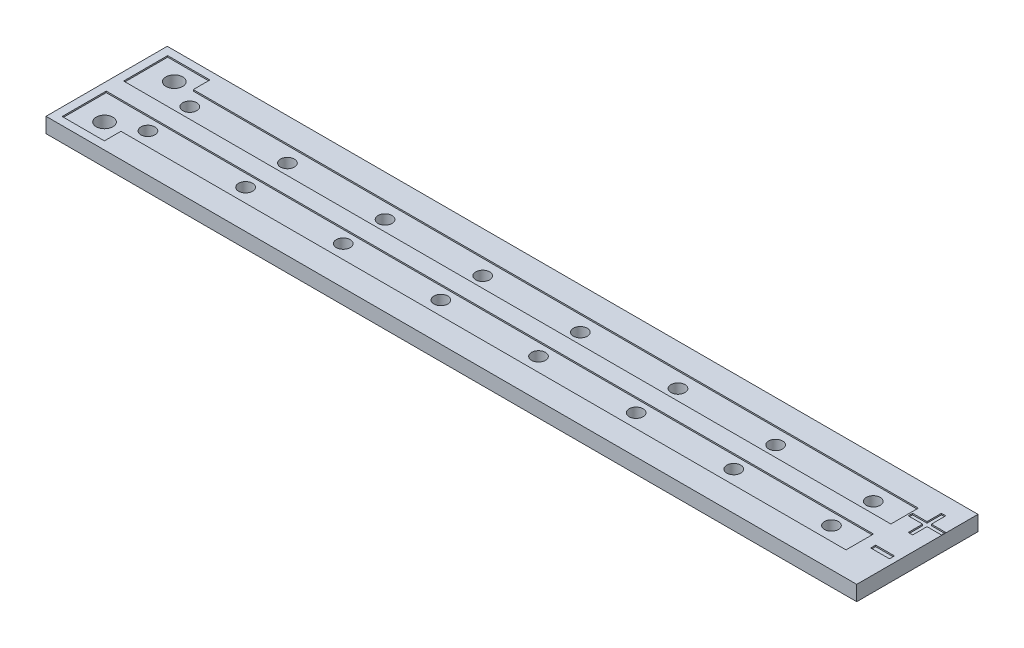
ISO-10303-21;
HEADER;
FILE_DESCRIPTION(('STEP AP214'),'2;1');
FILE_NAME('part.step','',(''),(''),'','','');
FILE_SCHEMA(('AUTOMOTIVE_DESIGN { 1 0 10303 214 1 1 1 1 }'));
ENDSEC;
DATA;
#1=APPLICATION_CONTEXT('core data for automotive mechanical design processes');
#2=APPLICATION_PROTOCOL_DEFINITION('international standard','automotive_design',2000,#1);
#3=PRODUCT_CONTEXT('',#1,'mechanical');
#4=PRODUCT('Part','Part','',(#3));
#5=PRODUCT_RELATED_PRODUCT_CATEGORY('part','',(#4));
#6=PRODUCT_DEFINITION_FORMATION('','',#4);
#7=PRODUCT_DEFINITION_CONTEXT('part definition',#1,'design');
#8=PRODUCT_DEFINITION('design','',#6,#7);
#9=PRODUCT_DEFINITION_SHAPE('','',#8);
#10=(LENGTH_UNIT() NAMED_UNIT(*) SI_UNIT(.MILLI.,.METRE.));
#11=(NAMED_UNIT(*) PLANE_ANGLE_UNIT() SI_UNIT($,.RADIAN.));
#12=(NAMED_UNIT(*) SI_UNIT($,.STERADIAN.) SOLID_ANGLE_UNIT());
#13=UNCERTAINTY_MEASURE_WITH_UNIT(LENGTH_MEASURE(1.E-05),#10,'distance_accuracy_value','');
#14=(GEOMETRIC_REPRESENTATION_CONTEXT(3) GLOBAL_UNCERTAINTY_ASSIGNED_CONTEXT((#13)) GLOBAL_UNIT_ASSIGNED_CONTEXT((#10,
#11,#12)) REPRESENTATION_CONTEXT('',''));
#15=CARTESIAN_POINT('',(0.,0.,0.));
#16=DIRECTION('',(0.,0.,1.));
#17=DIRECTION('',(1.,0.,0.));
#18=AXIS2_PLACEMENT_3D('',#15,#16,#17);
#19=CARTESIAN_POINT('',(0.,1.08,-8.69502075));
#20=DIRECTION('',(0.,-1.,0.));
#21=DIRECTION('',(0.,0.,-1.));
#22=AXIS2_PLACEMENT_3D('',#19,#20,#21);
#23=PLANE('',#22);
#24=DIRECTION('',(0.,0.,-1.));
#25=VECTOR('',#24,1.);
#26=CARTESIAN_POINT('',(3.61923810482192,1.08,-6.93915733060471));
#27=LINE('',#26,#25);
#28=CARTESIAN_POINT('',(3.61923810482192,1.08,-6.93915733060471));
#29=VERTEX_POINT('',#28);
#30=CARTESIAN_POINT('',(3.61923810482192,1.08,-8.13062874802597));
#31=VERTEX_POINT('',#30);
#32=EDGE_CURVE('E252',#29,#31,#27,.T.);
#33=ORIENTED_EDGE('',*,*,#32,.F.);
#34=DIRECTION('',(-1.,0.,0.));
#35=VECTOR('',#34,1.);
#36=CARTESIAN_POINT('',(55.5971663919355,1.08,-6.93915733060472));
#37=LINE('',#36,#35);
#38=CARTESIAN_POINT('',(55.5971663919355,1.08,-6.93915733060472));
#39=VERTEX_POINT('',#38);
#40=EDGE_CURVE('E43',#39,#29,#37,.T.);
#41=ORIENTED_EDGE('',*,*,#40,.F.);
#42=DIRECTION('',(0.,0.,-1.));
#43=VECTOR('',#42,1.);
#44=CARTESIAN_POINT('',(55.5971663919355,1.08,-4.97019244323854));
#45=LINE('',#44,#43);
#46=CARTESIAN_POINT('',(55.5971663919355,1.08,-4.97019244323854));
#47=VERTEX_POINT('',#46);
#48=EDGE_CURVE('E267',#47,#39,#45,.T.);
#49=ORIENTED_EDGE('',*,*,#48,.F.);
#50=DIRECTION('',(1.,0.,0.));
#51=VECTOR('',#50,1.);
#52=CARTESIAN_POINT('',(55.5971663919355,1.08,-4.97019244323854));
#53=LINE('',#52,#51);
#54=CARTESIAN_POINT('',(0.592578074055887,1.08,-4.97019244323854));
#55=VERTEX_POINT('',#54);
#56=EDGE_CURVE('E261',#55,#47,#53,.T.);
#57=ORIENTED_EDGE('',*,*,#56,.F.);
#58=DIRECTION('',(0.,0.,1.));
#59=VECTOR('',#58,1.);
#60=CARTESIAN_POINT('',(0.592578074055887,1.08,-4.97019244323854));
#61=LINE('',#60,#59);
#62=CARTESIAN_POINT('',(0.592578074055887,1.08,-8.13062874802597));
#63=VERTEX_POINT('',#62);
#64=EDGE_CURVE('E259',#63,#55,#61,.T.);
#65=ORIENTED_EDGE('',*,*,#64,.F.);
#66=DIRECTION('',(-1.,0.,0.));
#67=VECTOR('',#66,1.);
#68=CARTESIAN_POINT('',(0.592578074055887,1.08,-8.13062874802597));
#69=LINE('',#68,#67);
#70=EDGE_CURVE('E241',#31,#63,#69,.T.);
#71=ORIENTED_EDGE('',*,*,#70,.F.);
#72=EDGE_LOOP('',(#33,#41,#49,#57,#65,#71));
#73=FACE_BOUND('',#72,.T.);
#74=DIRECTION('',(-1.,0.,0.));
#75=VECTOR('',#74,1.);
#76=CARTESIAN_POINT('',(55.5971663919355,1.08,-3.72482830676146));
#77=LINE('',#76,#75);
#78=CARTESIAN_POINT('',(55.5971663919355,1.08,-3.72482830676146));
#79=VERTEX_POINT('',#78);
#80=CARTESIAN_POINT('',(0.592578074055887,1.08,-3.72482830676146));
#81=VERTEX_POINT('',#80);
#82=EDGE_CURVE('E318',#79,#81,#77,.T.);
#83=ORIENTED_EDGE('',*,*,#82,.F.);
#84=DIRECTION('',(0.,0.,-1.));
#85=VECTOR('',#84,1.);
#86=CARTESIAN_POINT('',(55.5971663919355,1.08,-3.72482830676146));
#87=LINE('',#86,#85);
#88=CARTESIAN_POINT('',(55.5971663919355,1.08,-1.75586341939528));
#89=VERTEX_POINT('',#88);
#90=EDGE_CURVE('E51',#89,#79,#87,.T.);
#91=ORIENTED_EDGE('',*,*,#90,.F.);
#92=DIRECTION('',(1.,0.,0.));
#93=VECTOR('',#92,1.);
#94=CARTESIAN_POINT('',(55.5971663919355,1.08,-1.75586341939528));
#95=LINE('',#94,#93);
#96=CARTESIAN_POINT('',(3.61923810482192,1.08,-1.75586341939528));
#97=VERTEX_POINT('',#96);
#98=EDGE_CURVE('E330',#97,#89,#95,.T.);
#99=ORIENTED_EDGE('',*,*,#98,.F.);
#100=DIRECTION('',(0.,0.,-1.));
#101=VECTOR('',#100,1.);
#102=CARTESIAN_POINT('',(3.61923810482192,1.08,-1.75586341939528));
#103=LINE('',#102,#101);
#104=CARTESIAN_POINT('',(3.61923810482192,1.08,-0.564392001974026));
#105=VERTEX_POINT('',#104);
#106=EDGE_CURVE('E327',#105,#97,#103,.T.);
#107=ORIENTED_EDGE('',*,*,#106,.F.);
#108=DIRECTION('',(1.,0.,0.));
#109=VECTOR('',#108,1.);
#110=CARTESIAN_POINT('',(0.592578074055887,1.08,-0.564392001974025));
#111=LINE('',#110,#109);
#112=CARTESIAN_POINT('',(0.592578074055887,1.08,-0.564392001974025));
#113=VERTEX_POINT('',#112);
#114=EDGE_CURVE('E324',#113,#105,#111,.T.);
#115=ORIENTED_EDGE('',*,*,#114,.F.);
#116=DIRECTION('',(0.,0.,1.));
#117=VECTOR('',#116,1.);
#118=CARTESIAN_POINT('',(0.592578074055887,1.08,-3.72482830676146));
#119=LINE('',#118,#117);
#120=EDGE_CURVE('E321',#81,#113,#119,.T.);
#121=ORIENTED_EDGE('',*,*,#120,.F.);
#122=EDGE_LOOP('',(#83,#91,#99,#107,#115,#121));
#123=FACE_BOUND('',#122,.T.);
#124=DIRECTION('',(-1.,0.,0.));
#125=VECTOR('',#124,1.);
#126=CARTESIAN_POINT('',(58.0893066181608,1.08,-6.10209042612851));
#127=LINE('',#126,#125);
#128=CARTESIAN_POINT('',(58.0893066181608,1.08,-6.10209042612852));
#129=VERTEX_POINT('',#128);
#130=CARTESIAN_POINT('',(57.0572553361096,1.08,-6.10209042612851));
#131=VERTEX_POINT('',#130);
#132=EDGE_CURVE('E419',#129,#131,#127,.T.);
#133=ORIENTED_EDGE('',*,*,#132,.T.);
#134=DIRECTION('',(0.,0.,1.));
#135=VECTOR('',#134,1.);
#136=CARTESIAN_POINT('',(57.0572553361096,1.08,-6.10209042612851));
#137=LINE('',#136,#135);
#138=CARTESIAN_POINT('',(57.0572553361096,1.08,-5.07003914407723));
#139=VERTEX_POINT('',#138);
#140=EDGE_CURVE('E422',#131,#139,#137,.T.);
#141=ORIENTED_EDGE('',*,*,#140,.T.);
#142=DIRECTION('',(-1.,0.,0.));
#143=VECTOR('',#142,1.);
#144=CARTESIAN_POINT('',(57.0572553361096,1.08,-5.07003914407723));
#145=LINE('',#144,#143);
#146=CARTESIAN_POINT('',(56.743152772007,1.08,-5.07003914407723));
#147=VERTEX_POINT('',#146);
#148=EDGE_CURVE('E425',#139,#147,#145,.T.);
#149=ORIENTED_EDGE('',*,*,#148,.T.);
#150=DIRECTION('',(0.,0.,-1.));
#151=VECTOR('',#150,1.);
#152=CARTESIAN_POINT('',(56.743152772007,1.08,-5.07003914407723));
#153=LINE('',#152,#151);
#154=CARTESIAN_POINT('',(56.743152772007,1.08,-6.10209042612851));
#155=VERTEX_POINT('',#154);
#156=EDGE_CURVE('E428',#147,#155,#153,.T.);
#157=ORIENTED_EDGE('',*,*,#156,.T.);
#158=DIRECTION('',(-1.,0.,0.));
#159=VECTOR('',#158,1.);
#160=CARTESIAN_POINT('',(56.743152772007,1.08,-6.10209042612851));
#161=LINE('',#160,#159);
#162=CARTESIAN_POINT('',(55.7111014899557,1.08,-6.10209042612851));
#163=VERTEX_POINT('',#162);
#164=EDGE_CURVE('E431',#155,#163,#161,.T.);
#165=ORIENTED_EDGE('',*,*,#164,.T.);
#166=DIRECTION('',(0.,0.,-1.));
#167=VECTOR('',#166,1.);
#168=CARTESIAN_POINT('',(55.7111014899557,1.08,-6.10209042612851));
#169=LINE('',#168,#167);
#170=CARTESIAN_POINT('',(55.7111014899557,1.08,-6.41619299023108));
#171=VERTEX_POINT('',#170);
#172=EDGE_CURVE('E434',#163,#171,#169,.T.);
#173=ORIENTED_EDGE('',*,*,#172,.T.);
#174=DIRECTION('',(1.,0.,0.));
#175=VECTOR('',#174,1.);
#176=CARTESIAN_POINT('',(55.7111014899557,1.08,-6.41619299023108));
#177=LINE('',#176,#175);
#178=CARTESIAN_POINT('',(56.743152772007,1.08,-6.41619299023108));
#179=VERTEX_POINT('',#178);
#180=EDGE_CURVE('E437',#171,#179,#177,.T.);
#181=ORIENTED_EDGE('',*,*,#180,.T.);
#182=DIRECTION('',(0.,0.,-1.));
#183=VECTOR('',#182,1.);
#184=CARTESIAN_POINT('',(56.743152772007,1.08,-6.41619299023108));
#185=LINE('',#184,#183);
#186=CARTESIAN_POINT('',(56.743152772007,1.08,-7.44824427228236));
#187=VERTEX_POINT('',#186);
#188=EDGE_CURVE('E440',#179,#187,#185,.T.);
#189=ORIENTED_EDGE('',*,*,#188,.T.);
#190=DIRECTION('',(1.,0.,0.));
#191=VECTOR('',#190,1.);
#192=CARTESIAN_POINT('',(56.743152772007,1.08,-7.44824427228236));
#193=LINE('',#192,#191);
#194=CARTESIAN_POINT('',(57.0572553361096,1.08,-7.44824427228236));
#195=VERTEX_POINT('',#194);
#196=EDGE_CURVE('E443',#187,#195,#193,.T.);
#197=ORIENTED_EDGE('',*,*,#196,.T.);
#198=DIRECTION('',(0.,0.,1.));
#199=VECTOR('',#198,1.);
#200=CARTESIAN_POINT('',(57.0572553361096,1.08,-7.44824427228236));
#201=LINE('',#200,#199);
#202=CARTESIAN_POINT('',(57.0572553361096,1.08,-6.41619299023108));
#203=VERTEX_POINT('',#202);
#204=EDGE_CURVE('E446',#195,#203,#201,.T.);
#205=ORIENTED_EDGE('',*,*,#204,.T.);
#206=DIRECTION('',(1.,0.,0.));
#207=VECTOR('',#206,1.);
#208=CARTESIAN_POINT('',(57.0572553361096,1.08,-6.41619299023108));
#209=LINE('',#208,#207);
#210=CARTESIAN_POINT('',(58.0893066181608,1.08,-6.41619299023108));
#211=VERTEX_POINT('',#210);
#212=EDGE_CURVE('E449',#203,#211,#209,.T.);
#213=ORIENTED_EDGE('',*,*,#212,.T.);
#214=DIRECTION('',(0.,0.,1.));
#215=VECTOR('',#214,1.);
#216=CARTESIAN_POINT('',(58.0893066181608,1.08,-6.41619299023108));
#217=LINE('',#216,#215);
#218=EDGE_CURVE('E452',#211,#129,#217,.T.);
#219=ORIENTED_EDGE('',*,*,#218,.T.);
#220=EDGE_LOOP('',(#133,#141,#149,#157,#165,#173,#181,#189,#197,#205,#213,#219));
#221=FACE_BOUND('',#220,.T.);
#222=DIRECTION('',(0.,0.,1.));
#223=VECTOR('',#222,1.);
#224=CARTESIAN_POINT('',(0.,1.08,0.));
#225=LINE('',#224,#223);
#226=CARTESIAN_POINT('',(0.,1.08,-8.69502075));
#227=VERTEX_POINT('',#226);
#228=CARTESIAN_POINT('',(0.,1.08,0.));
#229=VERTEX_POINT('',#228);
#230=EDGE_CURVE('E569',#227,#229,#225,.T.);
#231=ORIENTED_EDGE('',*,*,#230,.T.);
#232=DIRECTION('',(1.,0.,0.));
#233=VECTOR('',#232,1.);
#234=CARTESIAN_POINT('',(0.,1.08,0.));
#235=LINE('',#234,#233);
#236=CARTESIAN_POINT('',(58.12,1.08,0.));
#237=VERTEX_POINT('',#236);
#238=EDGE_CURVE('E572',#229,#237,#235,.T.);
#239=ORIENTED_EDGE('',*,*,#238,.T.);
#240=DIRECTION('',(0.,0.,-1.));
#241=VECTOR('',#240,1.);
#242=CARTESIAN_POINT('',(58.12,1.08,0.));
#243=LINE('',#242,#241);
#244=CARTESIAN_POINT('',(58.12,1.08,-8.69502075));
#245=VERTEX_POINT('',#244);
#246=EDGE_CURVE('E574',#237,#245,#243,.T.);
#247=ORIENTED_EDGE('',*,*,#246,.T.);
#248=DIRECTION('',(-1.,0.,0.));
#249=VECTOR('',#248,1.);
#250=CARTESIAN_POINT('',(0.,1.08,-8.69502075));
#251=LINE('',#250,#249);
#252=EDGE_CURVE('E576',#245,#227,#251,.T.);
#253=ORIENTED_EDGE('',*,*,#252,.T.);
#254=EDGE_LOOP('',(#231,#239,#247,#253));
#255=FACE_BOUND('',#254,.T.);
#256=DIRECTION('',(0.,0.,1.));
#257=VECTOR('',#256,1.);
#258=CARTESIAN_POINT('',(57.7089360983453,1.08,-3.11869181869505));
#259=LINE('',#258,#257);
#260=CARTESIAN_POINT('',(57.7089360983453,1.08,-3.11869181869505));
#261=VERTEX_POINT('',#260);
#262=CARTESIAN_POINT('',(57.7089360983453,1.08,-2.75971745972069));
#263=VERTEX_POINT('',#262);
#264=EDGE_CURVE('E388',#261,#263,#259,.T.);
#265=ORIENTED_EDGE('',*,*,#264,.T.);
#266=DIRECTION('',(-1.,0.,0.));
#267=VECTOR('',#266,1.);
#268=CARTESIAN_POINT('',(57.7089360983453,1.08,-2.75971745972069));
#269=LINE('',#268,#267);
#270=CARTESIAN_POINT('',(56.3627822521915,1.08,-2.75971745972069));
#271=VERTEX_POINT('',#270);
#272=EDGE_CURVE('E391',#263,#271,#269,.T.);
#273=ORIENTED_EDGE('',*,*,#272,.T.);
#274=DIRECTION('',(0.,0.,-1.));
#275=VECTOR('',#274,1.);
#276=CARTESIAN_POINT('',(56.3627822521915,1.08,-2.75971745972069));
#277=LINE('',#276,#275);
#278=CARTESIAN_POINT('',(56.3627822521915,1.08,-3.11869181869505));
#279=VERTEX_POINT('',#278);
#280=EDGE_CURVE('E394',#271,#279,#277,.T.);
#281=ORIENTED_EDGE('',*,*,#280,.T.);
#282=DIRECTION('',(1.,0.,0.));
#283=VECTOR('',#282,1.);
#284=CARTESIAN_POINT('',(56.3627822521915,1.08,-3.11869181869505));
#285=LINE('',#284,#283);
#286=EDGE_CURVE('E397',#279,#261,#285,.T.);
#287=ORIENTED_EDGE('',*,*,#286,.T.);
#288=EDGE_LOOP('',(#265,#273,#281,#287));
#289=FACE_BOUND('',#288,.T.);
#290=ADVANCED_FACE('F26',(#73,#123,#221,#255,#289),#23,.F.);
#291=CARTESIAN_POINT('',(0.,0.,-8.69502075));
#292=DIRECTION('',(0.,-1.,0.));
#293=DIRECTION('',(0.,0.,-1.));
#294=AXIS2_PLACEMENT_3D('',#291,#292,#293);
#295=PLANE('',#294);
#296=CARTESIAN_POINT('',(4.46,0.,-2.84751037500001));
#297=DIRECTION('',(0.,1.,0.));
#298=DIRECTION('',(0.,0.,-1.));
#299=AXIS2_PLACEMENT_3D('',#296,#297,#298);
#300=CIRCLE('',#299,0.5);
#301=CARTESIAN_POINT('',(4.46,0.,-3.34751037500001));
#302=VERTEX_POINT('',#301);
#303=EDGE_CURVE('E509',#302,#302,#300,.T.);
#304=ORIENTED_EDGE('',*,*,#303,.T.);
#305=EDGE_LOOP('',(#304));
#306=FACE_BOUND('',#305,.T.);
#307=CARTESIAN_POINT('',(18.46,0.,-2.84751037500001));
#308=DIRECTION('',(0.,1.,0.));
#309=DIRECTION('',(0.,0.,-1.));
#310=AXIS2_PLACEMENT_3D('',#307,#308,#309);
#311=CIRCLE('',#310,0.499999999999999);
#312=CARTESIAN_POINT('',(18.46,0.,-3.347510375));
#313=VERTEX_POINT('',#312);
#314=EDGE_CURVE('E515',#313,#313,#311,.T.);
#315=ORIENTED_EDGE('',*,*,#314,.T.);
#316=EDGE_LOOP('',(#315));
#317=FACE_BOUND('',#316,.T.);
#318=CARTESIAN_POINT('',(32.46,0.,-2.84751037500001));
#319=DIRECTION('',(0.,1.,0.));
#320=DIRECTION('',(0.,0.,-1.));
#321=AXIS2_PLACEMENT_3D('',#318,#319,#320);
#322=CIRCLE('',#321,0.499999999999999);
#323=CARTESIAN_POINT('',(32.46,0.,-3.347510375));
#324=VERTEX_POINT('',#323);
#325=EDGE_CURVE('E521',#324,#324,#322,.T.);
#326=ORIENTED_EDGE('',*,*,#325,.T.);
#327=EDGE_LOOP('',(#326));
#328=FACE_BOUND('',#327,.T.);
#329=CARTESIAN_POINT('',(46.46,0.,-2.84751037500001));
#330=DIRECTION('',(0.,1.,0.));
#331=DIRECTION('',(0.,0.,-1.));
#332=AXIS2_PLACEMENT_3D('',#329,#330,#331);
#333=CIRCLE('',#332,0.499999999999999);
#334=CARTESIAN_POINT('',(46.46,0.,-3.347510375));
#335=VERTEX_POINT('',#334);
#336=EDGE_CURVE('E527',#335,#335,#333,.T.);
#337=ORIENTED_EDGE('',*,*,#336,.T.);
#338=EDGE_LOOP('',(#337));
#339=FACE_BOUND('',#338,.T.);
#340=CARTESIAN_POINT('',(46.46,0.,-5.84751037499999));
#341=DIRECTION('',(0.,1.,0.));
#342=DIRECTION('',(0.,0.,1.));
#343=AXIS2_PLACEMENT_3D('',#340,#341,#342);
#344=CIRCLE('',#343,0.499999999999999);
#345=CARTESIAN_POINT('',(46.46,0.,-5.34751037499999));
#346=VERTEX_POINT('',#345);
#347=EDGE_CURVE('E533',#346,#346,#344,.T.);
#348=ORIENTED_EDGE('',*,*,#347,.T.);
#349=EDGE_LOOP('',(#348));
#350=FACE_BOUND('',#349,.T.);
#351=CARTESIAN_POINT('',(32.46,0.,-5.84751037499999));
#352=DIRECTION('',(0.,1.,0.));
#353=DIRECTION('',(0.,0.,1.));
#354=AXIS2_PLACEMENT_3D('',#351,#352,#353);
#355=CIRCLE('',#354,0.499999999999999);
#356=CARTESIAN_POINT('',(32.46,0.,-5.34751037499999));
#357=VERTEX_POINT('',#356);
#358=EDGE_CURVE('E539',#357,#357,#355,.T.);
#359=ORIENTED_EDGE('',*,*,#358,.T.);
#360=EDGE_LOOP('',(#359));
#361=FACE_BOUND('',#360,.T.);
#362=CARTESIAN_POINT('',(18.46,0.,-5.84751037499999));
#363=DIRECTION('',(0.,1.,0.));
#364=DIRECTION('',(0.,0.,1.));
#365=AXIS2_PLACEMENT_3D('',#362,#363,#364);
#366=CIRCLE('',#365,0.499999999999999);
#367=CARTESIAN_POINT('',(18.46,0.,-5.34751037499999));
#368=VERTEX_POINT('',#367);
#369=EDGE_CURVE('E545',#368,#368,#366,.T.);
#370=ORIENTED_EDGE('',*,*,#369,.T.);
#371=EDGE_LOOP('',(#370));
#372=FACE_BOUND('',#371,.T.);
#373=CARTESIAN_POINT('',(53.46,0.,-2.84751037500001));
#374=DIRECTION('',(0.,1.,0.));
#375=DIRECTION('',(0.,0.,-1.));
#376=AXIS2_PLACEMENT_3D('',#373,#374,#375);
#377=CIRCLE('',#376,0.499999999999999);
#378=CARTESIAN_POINT('',(53.46,0.,-3.347510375));
#379=VERTEX_POINT('',#378);
#380=EDGE_CURVE('E551',#379,#379,#377,.T.);
#381=ORIENTED_EDGE('',*,*,#380,.T.);
#382=EDGE_LOOP('',(#381));
#383=FACE_BOUND('',#382,.T.);
#384=CARTESIAN_POINT('',(2.35,0.,-6.84751037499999));
#385=DIRECTION('',(0.,1.,0.));
#386=DIRECTION('',(0.,0.,1.));
#387=AXIS2_PLACEMENT_3D('',#384,#385,#386);
#388=CIRCLE('',#387,0.6);
#389=CARTESIAN_POINT('',(2.35,0.,-6.24751037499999));
#390=VERTEX_POINT('',#389);
#391=EDGE_CURVE('E557',#390,#390,#388,.T.);
#392=ORIENTED_EDGE('',*,*,#391,.T.);
#393=EDGE_LOOP('',(#392));
#394=FACE_BOUND('',#393,.T.);
#395=DIRECTION('',(0.,0.,1.));
#396=VECTOR('',#395,1.);
#397=CARTESIAN_POINT('',(0.,0.,0.));
#398=LINE('',#397,#396);
#399=CARTESIAN_POINT('',(0.,0.,-8.69502075));
#400=VERTEX_POINT('',#399);
#401=CARTESIAN_POINT('',(0.,0.,0.));
#402=VERTEX_POINT('',#401);
#403=EDGE_CURVE('E560',#400,#402,#398,.T.);
#404=ORIENTED_EDGE('',*,*,#403,.F.);
#405=DIRECTION('',(-1.,0.,0.));
#406=VECTOR('',#405,1.);
#407=CARTESIAN_POINT('',(0.,0.,-8.69502075));
#408=LINE('',#407,#406);
#409=CARTESIAN_POINT('',(58.12,0.,-8.69502075));
#410=VERTEX_POINT('',#409);
#411=EDGE_CURVE('E567',#410,#400,#408,.T.);
#412=ORIENTED_EDGE('',*,*,#411,.F.);
#413=DIRECTION('',(0.,0.,-1.));
#414=VECTOR('',#413,1.);
#415=CARTESIAN_POINT('',(58.12,0.,0.));
#416=LINE('',#415,#414);
#417=CARTESIAN_POINT('',(58.12,0.,0.));
#418=VERTEX_POINT('',#417);
#419=EDGE_CURVE('E565',#418,#410,#416,.T.);
#420=ORIENTED_EDGE('',*,*,#419,.F.);
#421=DIRECTION('',(1.,0.,0.));
#422=VECTOR('',#421,1.);
#423=CARTESIAN_POINT('',(0.,0.,0.));
#424=LINE('',#423,#422);
#425=EDGE_CURVE('E563',#402,#418,#424,.T.);
#426=ORIENTED_EDGE('',*,*,#425,.F.);
#427=EDGE_LOOP('',(#404,#412,#420,#426));
#428=FACE_BOUND('',#427,.T.);
#429=CARTESIAN_POINT('',(4.46,0.,-5.84751037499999));
#430=DIRECTION('',(0.,1.,0.));
#431=DIRECTION('',(0.,0.,1.));
#432=AXIS2_PLACEMENT_3D('',#429,#430,#431);
#433=CIRCLE('',#432,0.5);
#434=CARTESIAN_POINT('',(4.46,0.,-5.34751037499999));
#435=VERTEX_POINT('',#434);
#436=EDGE_CURVE('E554',#435,#435,#433,.T.);
#437=ORIENTED_EDGE('',*,*,#436,.T.);
#438=EDGE_LOOP('',(#437));
#439=FACE_BOUND('',#438,.T.);
#440=CARTESIAN_POINT('',(11.46,0.,-5.84751037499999));
#441=DIRECTION('',(0.,1.,0.));
#442=DIRECTION('',(0.,0.,1.));
#443=AXIS2_PLACEMENT_3D('',#440,#441,#442);
#444=CIRCLE('',#443,0.500000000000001);
#445=CARTESIAN_POINT('',(11.46,0.,-5.34751037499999));
#446=VERTEX_POINT('',#445);
#447=EDGE_CURVE('E548',#446,#446,#444,.T.);
#448=ORIENTED_EDGE('',*,*,#447,.T.);
#449=EDGE_LOOP('',(#448));
#450=FACE_BOUND('',#449,.T.);
#451=CARTESIAN_POINT('',(25.46,0.,-5.84751037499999));
#452=DIRECTION('',(0.,1.,0.));
#453=DIRECTION('',(0.,0.,1.));
#454=AXIS2_PLACEMENT_3D('',#451,#452,#453);
#455=CIRCLE('',#454,0.500000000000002);
#456=CARTESIAN_POINT('',(25.46,0.,-5.34751037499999));
#457=VERTEX_POINT('',#456);
#458=EDGE_CURVE('E542',#457,#457,#455,.T.);
#459=ORIENTED_EDGE('',*,*,#458,.T.);
#460=EDGE_LOOP('',(#459));
#461=FACE_BOUND('',#460,.T.);
#462=CARTESIAN_POINT('',(39.46,0.,-5.84751037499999));
#463=DIRECTION('',(0.,1.,0.));
#464=DIRECTION('',(0.,0.,1.));
#465=AXIS2_PLACEMENT_3D('',#462,#463,#464);
#466=CIRCLE('',#465,0.499999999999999);
#467=CARTESIAN_POINT('',(39.46,0.,-5.34751037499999));
#468=VERTEX_POINT('',#467);
#469=EDGE_CURVE('E536',#468,#468,#466,.T.);
#470=ORIENTED_EDGE('',*,*,#469,.T.);
#471=EDGE_LOOP('',(#470));
#472=FACE_BOUND('',#471,.T.);
#473=CARTESIAN_POINT('',(53.46,0.,-5.84751037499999));
#474=DIRECTION('',(0.,1.,0.));
#475=DIRECTION('',(0.,0.,1.));
#476=AXIS2_PLACEMENT_3D('',#473,#474,#475);
#477=CIRCLE('',#476,0.499999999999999);
#478=CARTESIAN_POINT('',(53.46,0.,-5.34751037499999));
#479=VERTEX_POINT('',#478);
#480=EDGE_CURVE('E530',#479,#479,#477,.T.);
#481=ORIENTED_EDGE('',*,*,#480,.T.);
#482=EDGE_LOOP('',(#481));
#483=FACE_BOUND('',#482,.T.);
#484=CARTESIAN_POINT('',(39.46,0.,-2.84751037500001));
#485=DIRECTION('',(0.,1.,0.));
#486=DIRECTION('',(0.,0.,-1.));
#487=AXIS2_PLACEMENT_3D('',#484,#485,#486);
#488=CIRCLE('',#487,0.499999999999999);
#489=CARTESIAN_POINT('',(39.46,0.,-3.347510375));
#490=VERTEX_POINT('',#489);
#491=EDGE_CURVE('E524',#490,#490,#488,.T.);
#492=ORIENTED_EDGE('',*,*,#491,.T.);
#493=EDGE_LOOP('',(#492));
#494=FACE_BOUND('',#493,.T.);
#495=CARTESIAN_POINT('',(25.46,0.,-2.84751037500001));
#496=DIRECTION('',(0.,1.,0.));
#497=DIRECTION('',(0.,0.,-1.));
#498=AXIS2_PLACEMENT_3D('',#495,#496,#497);
#499=CIRCLE('',#498,0.500000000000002);
#500=CARTESIAN_POINT('',(25.46,0.,-3.34751037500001));
#501=VERTEX_POINT('',#500);
#502=EDGE_CURVE('E518',#501,#501,#499,.T.);
#503=ORIENTED_EDGE('',*,*,#502,.T.);
#504=EDGE_LOOP('',(#503));
#505=FACE_BOUND('',#504,.T.);
#506=CARTESIAN_POINT('',(11.46,0.,-2.84751037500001));
#507=DIRECTION('',(0.,1.,0.));
#508=DIRECTION('',(0.,0.,-1.));
#509=AXIS2_PLACEMENT_3D('',#506,#507,#508);
#510=CIRCLE('',#509,0.500000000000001);
#511=CARTESIAN_POINT('',(11.46,0.,-3.34751037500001));
#512=VERTEX_POINT('',#511);
#513=EDGE_CURVE('E512',#512,#512,#510,.T.);
#514=ORIENTED_EDGE('',*,*,#513,.T.);
#515=EDGE_LOOP('',(#514));
#516=FACE_BOUND('',#515,.T.);
#517=CARTESIAN_POINT('',(2.35,0.,-1.84751037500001));
#518=DIRECTION('',(0.,1.,0.));
#519=DIRECTION('',(0.,0.,-1.));
#520=AXIS2_PLACEMENT_3D('',#517,#518,#519);
#521=CIRCLE('',#520,0.6);
#522=CARTESIAN_POINT('',(2.35,0.,-2.44751037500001));
#523=VERTEX_POINT('',#522);
#524=EDGE_CURVE('E506',#523,#523,#521,.T.);
#525=ORIENTED_EDGE('',*,*,#524,.T.);
#526=EDGE_LOOP('',(#525));
#527=FACE_BOUND('',#526,.T.);
#528=ADVANCED_FACE('F599',(#306,#317,#328,#339,#350,#361,#372,#383,#394,#428,#439,#450,#461,
#472,#483,#494,#505,#516,#527),#295,.T.);
#529=CARTESIAN_POINT('',(0.,1.08,0.));
#530=DIRECTION('',(1.,0.,0.));
#531=DIRECTION('',(0.,0.,-1.));
#532=AXIS2_PLACEMENT_3D('',#529,#530,#531);
#533=PLANE('',#532);
#534=ORIENTED_EDGE('',*,*,#403,.T.);
#535=DIRECTION('',(0.,-1.,0.));
#536=VECTOR('',#535,1.);
#537=CARTESIAN_POINT('',(0.,1.08,0.));
#538=LINE('',#537,#536);
#539=EDGE_CURVE('E11',#229,#402,#538,.T.);
#540=ORIENTED_EDGE('',*,*,#539,.F.);
#541=ORIENTED_EDGE('',*,*,#230,.F.);
#542=DIRECTION('',(0.,-1.,0.));
#543=VECTOR('',#542,1.);
#544=CARTESIAN_POINT('',(0.,1.08,-8.69502075));
#545=LINE('',#544,#543);
#546=EDGE_CURVE('E578',#227,#400,#545,.T.);
#547=ORIENTED_EDGE('',*,*,#546,.T.);
#548=EDGE_LOOP('',(#534,#540,#541,#547));
#549=FACE_BOUND('',#548,.T.);
#550=ADVANCED_FACE('F28',(#549),#533,.F.);
#551=CARTESIAN_POINT('',(0.,1.08,0.));
#552=DIRECTION('',(0.,0.,-1.));
#553=DIRECTION('',(-1.,0.,0.));
#554=AXIS2_PLACEMENT_3D('',#551,#552,#553);
#555=PLANE('',#554);
#556=ORIENTED_EDGE('',*,*,#425,.T.);
#557=DIRECTION('',(0.,-1.,0.));
#558=VECTOR('',#557,1.);
#559=CARTESIAN_POINT('',(58.12,1.08,0.));
#560=LINE('',#559,#558);
#561=EDGE_CURVE('E35',#237,#418,#560,.T.);
#562=ORIENTED_EDGE('',*,*,#561,.F.);
#563=ORIENTED_EDGE('',*,*,#238,.F.);
#564=ORIENTED_EDGE('',*,*,#539,.T.);
#565=EDGE_LOOP('',(#556,#562,#563,#564));
#566=FACE_BOUND('',#565,.T.);
#567=ADVANCED_FACE('F606',(#566),#555,.F.);
#568=CARTESIAN_POINT('',(58.12,1.08,0.));
#569=DIRECTION('',(-1.,0.,0.));
#570=DIRECTION('',(0.,0.,1.));
#571=AXIS2_PLACEMENT_3D('',#568,#569,#570);
#572=PLANE('',#571);
#573=ORIENTED_EDGE('',*,*,#419,.T.);
#574=DIRECTION('',(0.,-1.,0.));
#575=VECTOR('',#574,1.);
#576=CARTESIAN_POINT('',(58.12,1.08,-8.69502075));
#577=LINE('',#576,#575);
#578=EDGE_CURVE('E581',#245,#410,#577,.T.);
#579=ORIENTED_EDGE('',*,*,#578,.F.);
#580=ORIENTED_EDGE('',*,*,#246,.F.);
#581=ORIENTED_EDGE('',*,*,#561,.T.);
#582=EDGE_LOOP('',(#573,#579,#580,#581));
#583=FACE_BOUND('',#582,.T.);
#584=ADVANCED_FACE('F618',(#583),#572,.F.);
#585=CARTESIAN_POINT('',(0.,1.08,-8.69502075));
#586=DIRECTION('',(0.,0.,1.));
#587=DIRECTION('',(1.,0.,0.));
#588=AXIS2_PLACEMENT_3D('',#585,#586,#587);
#589=PLANE('',#588);
#590=ORIENTED_EDGE('',*,*,#411,.T.);
#591=ORIENTED_EDGE('',*,*,#546,.F.);
#592=ORIENTED_EDGE('',*,*,#252,.F.);
#593=ORIENTED_EDGE('',*,*,#578,.T.);
#594=EDGE_LOOP('',(#590,#591,#592,#593));
#595=FACE_BOUND('',#594,.T.);
#596=ADVANCED_FACE('F615',(#595),#589,.F.);
#597=CARTESIAN_POINT('',(2.35,1.08,-6.84751037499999));
#598=DIRECTION('',(0.,-1.,0.));
#599=DIRECTION('',(0.,0.,-1.));
#600=AXIS2_PLACEMENT_3D('',#597,#598,#599);
#601=CYLINDRICAL_SURFACE('',#600,0.6);
#602=CARTESIAN_POINT('',(2.35,0.98,-6.84751037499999));
#603=DIRECTION('',(0.,-1.,0.));
#604=DIRECTION('',(0.,0.,-1.));
#605=AXIS2_PLACEMENT_3D('',#602,#603,#604);
#606=CIRCLE('',#605,0.6);
#607=CARTESIAN_POINT('',(2.35,0.98,-7.44751037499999));
#608=VERTEX_POINT('',#607);
#609=EDGE_CURVE('E314',#608,#608,#606,.T.);
#610=ORIENTED_EDGE('',*,*,#609,.F.);
#611=EDGE_LOOP('',(#610));
#612=FACE_BOUND('',#611,.T.);
#613=ORIENTED_EDGE('',*,*,#391,.F.);
#614=EDGE_LOOP('',(#613));
#615=FACE_BOUND('',#614,.T.);
#616=ADVANCED_FACE('F612',(#612,#615),#601,.F.);
#617=CARTESIAN_POINT('',(4.46,1.08,-5.84751037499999));
#618=DIRECTION('',(0.,-1.,0.));
#619=DIRECTION('',(0.,0.,-1.));
#620=AXIS2_PLACEMENT_3D('',#617,#618,#619);
#621=CYLINDRICAL_SURFACE('',#620,0.5);
#622=CARTESIAN_POINT('',(4.46,0.98,-5.84751037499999));
#623=DIRECTION('',(0.,-1.,0.));
#624=DIRECTION('',(0.,0.,-1.));
#625=AXIS2_PLACEMENT_3D('',#622,#623,#624);
#626=CIRCLE('',#625,0.5);
#627=CARTESIAN_POINT('',(4.46,0.98,-6.34751037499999));
#628=VERTEX_POINT('',#627);
#629=EDGE_CURVE('E311',#628,#628,#626,.T.);
#630=ORIENTED_EDGE('',*,*,#629,.F.);
#631=EDGE_LOOP('',(#630));
#632=FACE_BOUND('',#631,.T.);
#633=ORIENTED_EDGE('',*,*,#436,.F.);
#634=EDGE_LOOP('',(#633));
#635=FACE_BOUND('',#634,.T.);
#636=ADVANCED_FACE('F779',(#632,#635),#621,.F.);
#637=CARTESIAN_POINT('',(53.46,1.08,-2.84751037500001));
#638=DIRECTION('',(0.,-1.,0.));
#639=DIRECTION('',(0.,0.,-1.));
#640=AXIS2_PLACEMENT_3D('',#637,#638,#639);
#641=CYLINDRICAL_SURFACE('',#640,0.499999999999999);
#642=CARTESIAN_POINT('',(53.46,0.98,-2.84751037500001));
#643=DIRECTION('',(0.,-1.,0.));
#644=DIRECTION('',(0.,0.,-1.));
#645=AXIS2_PLACEMENT_3D('',#642,#643,#644);
#646=CIRCLE('',#645,0.499999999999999);
#647=CARTESIAN_POINT('',(53.46,0.98,-3.347510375));
#648=VERTEX_POINT('',#647);
#649=EDGE_CURVE('E385',#648,#648,#646,.T.);
#650=ORIENTED_EDGE('',*,*,#649,.F.);
#651=EDGE_LOOP('',(#650));
#652=FACE_BOUND('',#651,.T.);
#653=ORIENTED_EDGE('',*,*,#380,.F.);
#654=EDGE_LOOP('',(#653));
#655=FACE_BOUND('',#654,.T.);
#656=ADVANCED_FACE('F776',(#652,#655),#641,.F.);
#657=CARTESIAN_POINT('',(11.46,1.08,-5.84751037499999));
#658=DIRECTION('',(0.,-1.,0.));
#659=DIRECTION('',(0.,0.,-1.));
#660=AXIS2_PLACEMENT_3D('',#657,#658,#659);
#661=CYLINDRICAL_SURFACE('',#660,0.500000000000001);
#662=CARTESIAN_POINT('',(11.46,0.98,-5.84751037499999));
#663=DIRECTION('',(0.,-1.,0.));
#664=DIRECTION('',(0.,0.,-1.));
#665=AXIS2_PLACEMENT_3D('',#662,#663,#664);
#666=CIRCLE('',#665,0.500000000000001);
#667=CARTESIAN_POINT('',(11.46,0.98,-6.34751037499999));
#668=VERTEX_POINT('',#667);
#669=EDGE_CURVE('E308',#668,#668,#666,.T.);
#670=ORIENTED_EDGE('',*,*,#669,.F.);
#671=EDGE_LOOP('',(#670));
#672=FACE_BOUND('',#671,.T.);
#673=ORIENTED_EDGE('',*,*,#447,.F.);
#674=EDGE_LOOP('',(#673));
#675=FACE_BOUND('',#674,.T.);
#676=ADVANCED_FACE('F772',(#672,#675),#661,.F.);
#677=CARTESIAN_POINT('',(18.46,1.08,-5.84751037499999));
#678=DIRECTION('',(0.,-1.,0.));
#679=DIRECTION('',(0.,0.,-1.));
#680=AXIS2_PLACEMENT_3D('',#677,#678,#679);
#681=CYLINDRICAL_SURFACE('',#680,0.499999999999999);
#682=CARTESIAN_POINT('',(18.46,0.98,-5.84751037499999));
#683=DIRECTION('',(0.,-1.,0.));
#684=DIRECTION('',(0.,0.,-1.));
#685=AXIS2_PLACEMENT_3D('',#682,#683,#684);
#686=CIRCLE('',#685,0.499999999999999);
#687=CARTESIAN_POINT('',(18.46,0.98,-6.34751037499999));
#688=VERTEX_POINT('',#687);
#689=EDGE_CURVE('E305',#688,#688,#686,.T.);
#690=ORIENTED_EDGE('',*,*,#689,.F.);
#691=EDGE_LOOP('',(#690));
#692=FACE_BOUND('',#691,.T.);
#693=ORIENTED_EDGE('',*,*,#369,.F.);
#694=EDGE_LOOP('',(#693));
#695=FACE_BOUND('',#694,.T.);
#696=ADVANCED_FACE('F768',(#692,#695),#681,.F.);
#697=CARTESIAN_POINT('',(25.46,1.08,-5.84751037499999));
#698=DIRECTION('',(0.,-1.,0.));
#699=DIRECTION('',(0.,0.,-1.));
#700=AXIS2_PLACEMENT_3D('',#697,#698,#699);
#701=CYLINDRICAL_SURFACE('',#700,0.500000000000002);
#702=CARTESIAN_POINT('',(25.46,0.98,-5.84751037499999));
#703=DIRECTION('',(0.,-1.,0.));
#704=DIRECTION('',(0.,0.,-1.));
#705=AXIS2_PLACEMENT_3D('',#702,#703,#704);
#706=CIRCLE('',#705,0.500000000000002);
#707=CARTESIAN_POINT('',(25.46,0.98,-6.347510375));
#708=VERTEX_POINT('',#707);
#709=EDGE_CURVE('E302',#708,#708,#706,.T.);
#710=ORIENTED_EDGE('',*,*,#709,.F.);
#711=EDGE_LOOP('',(#710));
#712=FACE_BOUND('',#711,.T.);
#713=ORIENTED_EDGE('',*,*,#458,.F.);
#714=EDGE_LOOP('',(#713));
#715=FACE_BOUND('',#714,.T.);
#716=ADVANCED_FACE('F764',(#712,#715),#701,.F.);
#717=CARTESIAN_POINT('',(32.46,1.08,-5.84751037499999));
#718=DIRECTION('',(0.,-1.,0.));
#719=DIRECTION('',(0.,0.,-1.));
#720=AXIS2_PLACEMENT_3D('',#717,#718,#719);
#721=CYLINDRICAL_SURFACE('',#720,0.499999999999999);
#722=CARTESIAN_POINT('',(32.46,0.98,-5.84751037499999));
#723=DIRECTION('',(0.,-1.,0.));
#724=DIRECTION('',(0.,0.,-1.));
#725=AXIS2_PLACEMENT_3D('',#722,#723,#724);
#726=CIRCLE('',#725,0.499999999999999);
#727=CARTESIAN_POINT('',(32.46,0.98,-6.34751037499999));
#728=VERTEX_POINT('',#727);
#729=EDGE_CURVE('E299',#728,#728,#726,.T.);
#730=ORIENTED_EDGE('',*,*,#729,.F.);
#731=EDGE_LOOP('',(#730));
#732=FACE_BOUND('',#731,.T.);
#733=ORIENTED_EDGE('',*,*,#358,.F.);
#734=EDGE_LOOP('',(#733));
#735=FACE_BOUND('',#734,.T.);
#736=ADVANCED_FACE('F760',(#732,#735),#721,.F.);
#737=CARTESIAN_POINT('',(39.46,1.08,-5.84751037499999));
#738=DIRECTION('',(0.,-1.,0.));
#739=DIRECTION('',(0.,0.,-1.));
#740=AXIS2_PLACEMENT_3D('',#737,#738,#739);
#741=CYLINDRICAL_SURFACE('',#740,0.499999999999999);
#742=CARTESIAN_POINT('',(39.46,0.98,-5.84751037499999));
#743=DIRECTION('',(0.,-1.,0.));
#744=DIRECTION('',(0.,0.,-1.));
#745=AXIS2_PLACEMENT_3D('',#742,#743,#744);
#746=CIRCLE('',#745,0.499999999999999);
#747=CARTESIAN_POINT('',(39.46,0.98,-6.34751037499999));
#748=VERTEX_POINT('',#747);
#749=EDGE_CURVE('E296',#748,#748,#746,.T.);
#750=ORIENTED_EDGE('',*,*,#749,.F.);
#751=EDGE_LOOP('',(#750));
#752=FACE_BOUND('',#751,.T.);
#753=ORIENTED_EDGE('',*,*,#469,.F.);
#754=EDGE_LOOP('',(#753));
#755=FACE_BOUND('',#754,.T.);
#756=ADVANCED_FACE('F756',(#752,#755),#741,.F.);
#757=CARTESIAN_POINT('',(46.46,1.08,-5.84751037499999));
#758=DIRECTION('',(0.,-1.,0.));
#759=DIRECTION('',(0.,0.,-1.));
#760=AXIS2_PLACEMENT_3D('',#757,#758,#759);
#761=CYLINDRICAL_SURFACE('',#760,0.499999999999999);
#762=CARTESIAN_POINT('',(46.46,0.98,-5.84751037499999));
#763=DIRECTION('',(0.,-1.,0.));
#764=DIRECTION('',(0.,0.,-1.));
#765=AXIS2_PLACEMENT_3D('',#762,#763,#764);
#766=CIRCLE('',#765,0.499999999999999);
#767=CARTESIAN_POINT('',(46.46,0.98,-6.34751037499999));
#768=VERTEX_POINT('',#767);
#769=EDGE_CURVE('E293',#768,#768,#766,.T.);
#770=ORIENTED_EDGE('',*,*,#769,.F.);
#771=EDGE_LOOP('',(#770));
#772=FACE_BOUND('',#771,.T.);
#773=ORIENTED_EDGE('',*,*,#347,.F.);
#774=EDGE_LOOP('',(#773));
#775=FACE_BOUND('',#774,.T.);
#776=ADVANCED_FACE('F752',(#772,#775),#761,.F.);
#777=CARTESIAN_POINT('',(53.46,1.08,-5.84751037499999));
#778=DIRECTION('',(0.,-1.,0.));
#779=DIRECTION('',(0.,0.,-1.));
#780=AXIS2_PLACEMENT_3D('',#777,#778,#779);
#781=CYLINDRICAL_SURFACE('',#780,0.499999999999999);
#782=CARTESIAN_POINT('',(53.46,0.98,-5.84751037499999));
#783=DIRECTION('',(0.,-1.,0.));
#784=DIRECTION('',(0.,0.,-1.));
#785=AXIS2_PLACEMENT_3D('',#782,#783,#784);
#786=CIRCLE('',#785,0.499999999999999);
#787=CARTESIAN_POINT('',(53.46,0.98,-6.34751037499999));
#788=VERTEX_POINT('',#787);
#789=EDGE_CURVE('E30',#788,#788,#786,.T.);
#790=ORIENTED_EDGE('',*,*,#789,.F.);
#791=EDGE_LOOP('',(#790));
#792=FACE_BOUND('',#791,.T.);
#793=ORIENTED_EDGE('',*,*,#480,.F.);
#794=EDGE_LOOP('',(#793));
#795=FACE_BOUND('',#794,.T.);
#796=ADVANCED_FACE('F748',(#792,#795),#781,.F.);
#797=CARTESIAN_POINT('',(46.46,1.08,-2.84751037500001));
#798=DIRECTION('',(0.,-1.,0.));
#799=DIRECTION('',(0.,0.,-1.));
#800=AXIS2_PLACEMENT_3D('',#797,#798,#799);
#801=CYLINDRICAL_SURFACE('',#800,0.499999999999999);
#802=CARTESIAN_POINT('',(46.46,0.98,-2.84751037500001));
#803=DIRECTION('',(0.,-1.,0.));
#804=DIRECTION('',(0.,0.,-1.));
#805=AXIS2_PLACEMENT_3D('',#802,#803,#804);
#806=CIRCLE('',#805,0.499999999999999);
#807=CARTESIAN_POINT('',(46.46,0.98,-3.347510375));
#808=VERTEX_POINT('',#807);
#809=EDGE_CURVE('E382',#808,#808,#806,.T.);
#810=ORIENTED_EDGE('',*,*,#809,.F.);
#811=EDGE_LOOP('',(#810));
#812=FACE_BOUND('',#811,.T.);
#813=ORIENTED_EDGE('',*,*,#336,.F.);
#814=EDGE_LOOP('',(#813));
#815=FACE_BOUND('',#814,.T.);
#816=ADVANCED_FACE('F744',(#812,#815),#801,.F.);
#817=CARTESIAN_POINT('',(39.46,1.08,-2.84751037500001));
#818=DIRECTION('',(0.,-1.,0.));
#819=DIRECTION('',(0.,0.,-1.));
#820=AXIS2_PLACEMENT_3D('',#817,#818,#819);
#821=CYLINDRICAL_SURFACE('',#820,0.499999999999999);
#822=CARTESIAN_POINT('',(39.46,0.98,-2.84751037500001));
#823=DIRECTION('',(0.,-1.,0.));
#824=DIRECTION('',(0.,0.,-1.));
#825=AXIS2_PLACEMENT_3D('',#822,#823,#824);
#826=CIRCLE('',#825,0.499999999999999);
#827=CARTESIAN_POINT('',(39.46,0.98,-3.347510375));
#828=VERTEX_POINT('',#827);
#829=EDGE_CURVE('E379',#828,#828,#826,.T.);
#830=ORIENTED_EDGE('',*,*,#829,.F.);
#831=EDGE_LOOP('',(#830));
#832=FACE_BOUND('',#831,.T.);
#833=ORIENTED_EDGE('',*,*,#491,.F.);
#834=EDGE_LOOP('',(#833));
#835=FACE_BOUND('',#834,.T.);
#836=ADVANCED_FACE('F740',(#832,#835),#821,.F.);
#837=CARTESIAN_POINT('',(32.46,1.08,-2.84751037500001));
#838=DIRECTION('',(0.,-1.,0.));
#839=DIRECTION('',(0.,0.,-1.));
#840=AXIS2_PLACEMENT_3D('',#837,#838,#839);
#841=CYLINDRICAL_SURFACE('',#840,0.499999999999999);
#842=CARTESIAN_POINT('',(32.46,0.98,-2.84751037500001));
#843=DIRECTION('',(0.,-1.,0.));
#844=DIRECTION('',(0.,0.,-1.));
#845=AXIS2_PLACEMENT_3D('',#842,#843,#844);
#846=CIRCLE('',#845,0.499999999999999);
#847=CARTESIAN_POINT('',(32.46,0.98,-3.347510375));
#848=VERTEX_POINT('',#847);
#849=EDGE_CURVE('E376',#848,#848,#846,.T.);
#850=ORIENTED_EDGE('',*,*,#849,.F.);
#851=EDGE_LOOP('',(#850));
#852=FACE_BOUND('',#851,.T.);
#853=ORIENTED_EDGE('',*,*,#325,.F.);
#854=EDGE_LOOP('',(#853));
#855=FACE_BOUND('',#854,.T.);
#856=ADVANCED_FACE('F736',(#852,#855),#841,.F.);
#857=CARTESIAN_POINT('',(25.46,1.08,-2.84751037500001));
#858=DIRECTION('',(0.,-1.,0.));
#859=DIRECTION('',(0.,0.,-1.));
#860=AXIS2_PLACEMENT_3D('',#857,#858,#859);
#861=CYLINDRICAL_SURFACE('',#860,0.500000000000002);
#862=CARTESIAN_POINT('',(25.46,0.98,-2.84751037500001));
#863=DIRECTION('',(0.,-1.,0.));
#864=DIRECTION('',(0.,0.,-1.));
#865=AXIS2_PLACEMENT_3D('',#862,#863,#864);
#866=CIRCLE('',#865,0.500000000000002);
#867=CARTESIAN_POINT('',(25.46,0.98,-3.34751037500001));
#868=VERTEX_POINT('',#867);
#869=EDGE_CURVE('E373',#868,#868,#866,.T.);
#870=ORIENTED_EDGE('',*,*,#869,.F.);
#871=EDGE_LOOP('',(#870));
#872=FACE_BOUND('',#871,.T.);
#873=ORIENTED_EDGE('',*,*,#502,.F.);
#874=EDGE_LOOP('',(#873));
#875=FACE_BOUND('',#874,.T.);
#876=ADVANCED_FACE('F732',(#872,#875),#861,.F.);
#877=CARTESIAN_POINT('',(18.46,1.08,-2.84751037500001));
#878=DIRECTION('',(0.,-1.,0.));
#879=DIRECTION('',(0.,0.,-1.));
#880=AXIS2_PLACEMENT_3D('',#877,#878,#879);
#881=CYLINDRICAL_SURFACE('',#880,0.499999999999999);
#882=CARTESIAN_POINT('',(18.46,0.98,-2.84751037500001));
#883=DIRECTION('',(0.,-1.,0.));
#884=DIRECTION('',(0.,0.,-1.));
#885=AXIS2_PLACEMENT_3D('',#882,#883,#884);
#886=CIRCLE('',#885,0.499999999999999);
#887=CARTESIAN_POINT('',(18.46,0.98,-3.347510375));
#888=VERTEX_POINT('',#887);
#889=EDGE_CURVE('E370',#888,#888,#886,.T.);
#890=ORIENTED_EDGE('',*,*,#889,.F.);
#891=EDGE_LOOP('',(#890));
#892=FACE_BOUND('',#891,.T.);
#893=ORIENTED_EDGE('',*,*,#314,.F.);
#894=EDGE_LOOP('',(#893));
#895=FACE_BOUND('',#894,.T.);
#896=ADVANCED_FACE('F728',(#892,#895),#881,.F.);
#897=CARTESIAN_POINT('',(11.46,1.08,-2.84751037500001));
#898=DIRECTION('',(0.,-1.,0.));
#899=DIRECTION('',(0.,0.,-1.));
#900=AXIS2_PLACEMENT_3D('',#897,#898,#899);
#901=CYLINDRICAL_SURFACE('',#900,0.500000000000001);
#902=CARTESIAN_POINT('',(11.46,0.98,-2.84751037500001));
#903=DIRECTION('',(0.,-1.,0.));
#904=DIRECTION('',(0.,0.,-1.));
#905=AXIS2_PLACEMENT_3D('',#902,#903,#904);
#906=CIRCLE('',#905,0.500000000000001);
#907=CARTESIAN_POINT('',(11.46,0.98,-3.34751037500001));
#908=VERTEX_POINT('',#907);
#909=EDGE_CURVE('E367',#908,#908,#906,.T.);
#910=ORIENTED_EDGE('',*,*,#909,.F.);
#911=EDGE_LOOP('',(#910));
#912=FACE_BOUND('',#911,.T.);
#913=ORIENTED_EDGE('',*,*,#513,.F.);
#914=EDGE_LOOP('',(#913));
#915=FACE_BOUND('',#914,.T.);
#916=ADVANCED_FACE('F724',(#912,#915),#901,.F.);
#917=CARTESIAN_POINT('',(4.46,1.08,-2.84751037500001));
#918=DIRECTION('',(0.,-1.,0.));
#919=DIRECTION('',(0.,0.,-1.));
#920=AXIS2_PLACEMENT_3D('',#917,#918,#919);
#921=CYLINDRICAL_SURFACE('',#920,0.5);
#922=CARTESIAN_POINT('',(4.46,0.98,-2.84751037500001));
#923=DIRECTION('',(0.,-1.,0.));
#924=DIRECTION('',(0.,0.,-1.));
#925=AXIS2_PLACEMENT_3D('',#922,#923,#924);
#926=CIRCLE('',#925,0.5);
#927=CARTESIAN_POINT('',(4.46,0.98,-3.34751037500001));
#928=VERTEX_POINT('',#927);
#929=EDGE_CURVE('E364',#928,#928,#926,.T.);
#930=ORIENTED_EDGE('',*,*,#929,.F.);
#931=EDGE_LOOP('',(#930));
#932=FACE_BOUND('',#931,.T.);
#933=ORIENTED_EDGE('',*,*,#303,.F.);
#934=EDGE_LOOP('',(#933));
#935=FACE_BOUND('',#934,.T.);
#936=ADVANCED_FACE('F595',(#932,#935),#921,.F.);
#937=CARTESIAN_POINT('',(2.35,1.08,-1.84751037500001));
#938=DIRECTION('',(0.,-1.,0.));
#939=DIRECTION('',(0.,0.,-1.));
#940=AXIS2_PLACEMENT_3D('',#937,#938,#939);
#941=CYLINDRICAL_SURFACE('',#940,0.6);
#942=CARTESIAN_POINT('',(2.35,0.98,-1.84751037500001));
#943=DIRECTION('',(0.,-1.,0.));
#944=DIRECTION('',(0.,0.,-1.));
#945=AXIS2_PLACEMENT_3D('',#942,#943,#944);
#946=CIRCLE('',#945,0.6);
#947=CARTESIAN_POINT('',(2.35,0.98,-2.44751037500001));
#948=VERTEX_POINT('',#947);
#949=EDGE_CURVE('E354',#948,#948,#946,.T.);
#950=ORIENTED_EDGE('',*,*,#949,.F.);
#951=EDGE_LOOP('',(#950));
#952=FACE_BOUND('',#951,.T.);
#953=ORIENTED_EDGE('',*,*,#524,.F.);
#954=EDGE_LOOP('',(#953));
#955=FACE_BOUND('',#954,.T.);
#956=ADVANCED_FACE('F591',(#952,#955),#941,.F.);
#957=CARTESIAN_POINT('',(58.0893066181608,0.98,-6.10209042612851));
#958=DIRECTION('',(0.,0.,-1.));
#959=DIRECTION('',(-1.,0.,0.));
#960=AXIS2_PLACEMENT_3D('',#957,#958,#959);
#961=PLANE('',#960);
#962=ORIENTED_EDGE('',*,*,#132,.F.);
#963=DIRECTION('',(0.,1.,0.));
#964=VECTOR('',#963,1.);
#965=CARTESIAN_POINT('',(58.0893066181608,0.98,-6.10209042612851));
#966=LINE('',#965,#964);
#967=CARTESIAN_POINT('',(58.0893066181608,0.98,-6.10209042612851));
#968=VERTEX_POINT('',#967);
#969=EDGE_CURVE('E480',#968,#129,#966,.T.);
#970=ORIENTED_EDGE('',*,*,#969,.F.);
#971=DIRECTION('',(-1.,0.,0.));
#972=VECTOR('',#971,1.);
#973=CARTESIAN_POINT('',(58.0893066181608,0.98,-6.10209042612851));
#974=LINE('',#973,#972);
#975=CARTESIAN_POINT('',(57.0572553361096,0.98,-6.10209042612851));
#976=VERTEX_POINT('',#975);
#977=EDGE_CURVE('E455',#968,#976,#974,.T.);
#978=ORIENTED_EDGE('',*,*,#977,.T.);
#979=DIRECTION('',(0.,1.,0.));
#980=VECTOR('',#979,1.);
#981=CARTESIAN_POINT('',(57.0572553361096,0.98,-6.10209042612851));
#982=LINE('',#981,#980);
#983=EDGE_CURVE('E503',#976,#131,#982,.T.);
#984=ORIENTED_EDGE('',*,*,#983,.T.);
#985=EDGE_LOOP('',(#962,#970,#978,#984));
#986=FACE_BOUND('',#985,.T.);
#987=ADVANCED_FACE('F594',(#986),#961,.T.);
#988=CARTESIAN_POINT('',(57.0572553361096,0.98,-6.10209042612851));
#989=DIRECTION('',(-1.,0.,0.));
#990=DIRECTION('',(0.,0.,1.));
#991=AXIS2_PLACEMENT_3D('',#988,#989,#990);
#992=PLANE('',#991);
#993=ORIENTED_EDGE('',*,*,#140,.F.);
#994=ORIENTED_EDGE('',*,*,#983,.F.);
#995=DIRECTION('',(0.,0.,1.));
#996=VECTOR('',#995,1.);
#997=CARTESIAN_POINT('',(57.0572553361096,0.98,-6.10209042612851));
#998=LINE('',#997,#996);
#999=CARTESIAN_POINT('',(57.0572553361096,0.98,-5.07003914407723));
#1000=VERTEX_POINT('',#999);
#1001=EDGE_CURVE('E458',#976,#1000,#998,.T.);
#1002=ORIENTED_EDGE('',*,*,#1001,.T.);
#1003=DIRECTION('',(0.,1.,0.));
#1004=VECTOR('',#1003,1.);
#1005=CARTESIAN_POINT('',(57.0572553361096,0.98,-5.07003914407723));
#1006=LINE('',#1005,#1004);
#1007=EDGE_CURVE('E501',#1000,#139,#1006,.T.);
#1008=ORIENTED_EDGE('',*,*,#1007,.T.);
#1009=EDGE_LOOP('',(#993,#994,#1002,#1008));
#1010=FACE_BOUND('',#1009,.T.);
#1011=ADVANCED_FACE('F714',(#1010),#992,.T.);
#1012=CARTESIAN_POINT('',(57.0572553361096,0.98,-5.07003914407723));
#1013=DIRECTION('',(0.,0.,-1.));
#1014=DIRECTION('',(-1.,0.,0.));
#1015=AXIS2_PLACEMENT_3D('',#1012,#1013,#1014);
#1016=PLANE('',#1015);
#1017=ORIENTED_EDGE('',*,*,#148,.F.);
#1018=ORIENTED_EDGE('',*,*,#1007,.F.);
#1019=DIRECTION('',(-1.,0.,0.));
#1020=VECTOR('',#1019,1.);
#1021=CARTESIAN_POINT('',(57.0572553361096,0.98,-5.07003914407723));
#1022=LINE('',#1021,#1020);
#1023=CARTESIAN_POINT('',(56.743152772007,0.98,-5.07003914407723));
#1024=VERTEX_POINT('',#1023);
#1025=EDGE_CURVE('E460',#1000,#1024,#1022,.T.);
#1026=ORIENTED_EDGE('',*,*,#1025,.T.);
#1027=DIRECTION('',(0.,1.,0.));
#1028=VECTOR('',#1027,1.);
#1029=CARTESIAN_POINT('',(56.743152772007,0.98,-5.07003914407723));
#1030=LINE('',#1029,#1028);
#1031=EDGE_CURVE('E499',#1024,#147,#1030,.T.);
#1032=ORIENTED_EDGE('',*,*,#1031,.T.);
#1033=EDGE_LOOP('',(#1017,#1018,#1026,#1032));
#1034=FACE_BOUND('',#1033,.T.);
#1035=ADVANCED_FACE('F710',(#1034),#1016,.T.);
#1036=CARTESIAN_POINT('',(56.743152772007,0.98,-5.07003914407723));
#1037=DIRECTION('',(1.,0.,0.));
#1038=DIRECTION('',(0.,0.,-1.));
#1039=AXIS2_PLACEMENT_3D('',#1036,#1037,#1038);
#1040=PLANE('',#1039);
#1041=ORIENTED_EDGE('',*,*,#156,.F.);
#1042=ORIENTED_EDGE('',*,*,#1031,.F.);
#1043=DIRECTION('',(0.,0.,-1.));
#1044=VECTOR('',#1043,1.);
#1045=CARTESIAN_POINT('',(56.743152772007,0.98,-5.07003914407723));
#1046=LINE('',#1045,#1044);
#1047=CARTESIAN_POINT('',(56.743152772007,0.98,-6.10209042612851));
#1048=VERTEX_POINT('',#1047);
#1049=EDGE_CURVE('E462',#1024,#1048,#1046,.T.);
#1050=ORIENTED_EDGE('',*,*,#1049,.T.);
#1051=DIRECTION('',(0.,1.,0.));
#1052=VECTOR('',#1051,1.);
#1053=CARTESIAN_POINT('',(56.743152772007,0.98,-6.10209042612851));
#1054=LINE('',#1053,#1052);
#1055=EDGE_CURVE('E497',#1048,#155,#1054,.T.);
#1056=ORIENTED_EDGE('',*,*,#1055,.T.);
#1057=EDGE_LOOP('',(#1041,#1042,#1050,#1056));
#1058=FACE_BOUND('',#1057,.T.);
#1059=ADVANCED_FACE('F706',(#1058),#1040,.T.);
#1060=CARTESIAN_POINT('',(56.743152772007,0.98,-6.10209042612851));
#1061=DIRECTION('',(0.,0.,-1.));
#1062=DIRECTION('',(-1.,0.,0.));
#1063=AXIS2_PLACEMENT_3D('',#1060,#1061,#1062);
#1064=PLANE('',#1063);
#1065=ORIENTED_EDGE('',*,*,#164,.F.);
#1066=ORIENTED_EDGE('',*,*,#1055,.F.);
#1067=DIRECTION('',(-1.,0.,0.));
#1068=VECTOR('',#1067,1.);
#1069=CARTESIAN_POINT('',(56.743152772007,0.98,-6.10209042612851));
#1070=LINE('',#1069,#1068);
#1071=CARTESIAN_POINT('',(55.7111014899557,0.98,-6.10209042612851));
#1072=VERTEX_POINT('',#1071);
#1073=EDGE_CURVE('E464',#1048,#1072,#1070,.T.);
#1074=ORIENTED_EDGE('',*,*,#1073,.T.);
#1075=DIRECTION('',(0.,1.,0.));
#1076=VECTOR('',#1075,1.);
#1077=CARTESIAN_POINT('',(55.7111014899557,0.98,-6.10209042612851));
#1078=LINE('',#1077,#1076);
#1079=EDGE_CURVE('E495',#1072,#163,#1078,.T.);
#1080=ORIENTED_EDGE('',*,*,#1079,.T.);
#1081=EDGE_LOOP('',(#1065,#1066,#1074,#1080));
#1082=FACE_BOUND('',#1081,.T.);
#1083=ADVANCED_FACE('F702',(#1082),#1064,.T.);
#1084=CARTESIAN_POINT('',(55.7111014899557,0.98,-6.10209042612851));
#1085=DIRECTION('',(1.,0.,0.));
#1086=DIRECTION('',(0.,0.,-1.));
#1087=AXIS2_PLACEMENT_3D('',#1084,#1085,#1086);
#1088=PLANE('',#1087);
#1089=ORIENTED_EDGE('',*,*,#172,.F.);
#1090=ORIENTED_EDGE('',*,*,#1079,.F.);
#1091=DIRECTION('',(0.,0.,-1.));
#1092=VECTOR('',#1091,1.);
#1093=CARTESIAN_POINT('',(55.7111014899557,0.98,-6.10209042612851));
#1094=LINE('',#1093,#1092);
#1095=CARTESIAN_POINT('',(55.7111014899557,0.98,-6.41619299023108));
#1096=VERTEX_POINT('',#1095);
#1097=EDGE_CURVE('E466',#1072,#1096,#1094,.T.);
#1098=ORIENTED_EDGE('',*,*,#1097,.T.);
#1099=DIRECTION('',(0.,1.,0.));
#1100=VECTOR('',#1099,1.);
#1101=CARTESIAN_POINT('',(55.7111014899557,0.98,-6.41619299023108));
#1102=LINE('',#1101,#1100);
#1103=EDGE_CURVE('E493',#1096,#171,#1102,.T.);
#1104=ORIENTED_EDGE('',*,*,#1103,.T.);
#1105=EDGE_LOOP('',(#1089,#1090,#1098,#1104));
#1106=FACE_BOUND('',#1105,.T.);
#1107=ADVANCED_FACE('F698',(#1106),#1088,.T.);
#1108=CARTESIAN_POINT('',(55.7111014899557,0.98,-6.41619299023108));
#1109=DIRECTION('',(0.,0.,1.));
#1110=DIRECTION('',(1.,0.,0.));
#1111=AXIS2_PLACEMENT_3D('',#1108,#1109,#1110);
#1112=PLANE('',#1111);
#1113=ORIENTED_EDGE('',*,*,#180,.F.);
#1114=ORIENTED_EDGE('',*,*,#1103,.F.);
#1115=DIRECTION('',(1.,0.,0.));
#1116=VECTOR('',#1115,1.);
#1117=CARTESIAN_POINT('',(55.7111014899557,0.98,-6.41619299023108));
#1118=LINE('',#1117,#1116);
#1119=CARTESIAN_POINT('',(56.743152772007,0.98,-6.41619299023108));
#1120=VERTEX_POINT('',#1119);
#1121=EDGE_CURVE('E468',#1096,#1120,#1118,.T.);
#1122=ORIENTED_EDGE('',*,*,#1121,.T.);
#1123=DIRECTION('',(0.,1.,0.));
#1124=VECTOR('',#1123,1.);
#1125=CARTESIAN_POINT('',(56.743152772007,0.98,-6.41619299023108));
#1126=LINE('',#1125,#1124);
#1127=EDGE_CURVE('E491',#1120,#179,#1126,.T.);
#1128=ORIENTED_EDGE('',*,*,#1127,.T.);
#1129=EDGE_LOOP('',(#1113,#1114,#1122,#1128));
#1130=FACE_BOUND('',#1129,.T.);
#1131=ADVANCED_FACE('F694',(#1130),#1112,.T.);
#1132=CARTESIAN_POINT('',(56.743152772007,0.98,-6.41619299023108));
#1133=DIRECTION('',(1.,0.,0.));
#1134=DIRECTION('',(0.,0.,-1.));
#1135=AXIS2_PLACEMENT_3D('',#1132,#1133,#1134);
#1136=PLANE('',#1135);
#1137=ORIENTED_EDGE('',*,*,#188,.F.);
#1138=ORIENTED_EDGE('',*,*,#1127,.F.);
#1139=DIRECTION('',(0.,0.,-1.));
#1140=VECTOR('',#1139,1.);
#1141=CARTESIAN_POINT('',(56.743152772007,0.98,-6.41619299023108));
#1142=LINE('',#1141,#1140);
#1143=CARTESIAN_POINT('',(56.743152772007,0.98,-7.44824427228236));
#1144=VERTEX_POINT('',#1143);
#1145=EDGE_CURVE('E470',#1120,#1144,#1142,.T.);
#1146=ORIENTED_EDGE('',*,*,#1145,.T.);
#1147=DIRECTION('',(0.,1.,0.));
#1148=VECTOR('',#1147,1.);
#1149=CARTESIAN_POINT('',(56.743152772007,0.98,-7.44824427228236));
#1150=LINE('',#1149,#1148);
#1151=EDGE_CURVE('E489',#1144,#187,#1150,.T.);
#1152=ORIENTED_EDGE('',*,*,#1151,.T.);
#1153=EDGE_LOOP('',(#1137,#1138,#1146,#1152));
#1154=FACE_BOUND('',#1153,.T.);
#1155=ADVANCED_FACE('F690',(#1154),#1136,.T.);
#1156=CARTESIAN_POINT('',(56.743152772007,0.98,-7.44824427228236));
#1157=DIRECTION('',(0.,0.,1.));
#1158=DIRECTION('',(1.,0.,0.));
#1159=AXIS2_PLACEMENT_3D('',#1156,#1157,#1158);
#1160=PLANE('',#1159);
#1161=ORIENTED_EDGE('',*,*,#196,.F.);
#1162=ORIENTED_EDGE('',*,*,#1151,.F.);
#1163=DIRECTION('',(1.,0.,0.));
#1164=VECTOR('',#1163,1.);
#1165=CARTESIAN_POINT('',(56.743152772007,0.98,-7.44824427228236));
#1166=LINE('',#1165,#1164);
#1167=CARTESIAN_POINT('',(57.0572553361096,0.98,-7.44824427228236));
#1168=VERTEX_POINT('',#1167);
#1169=EDGE_CURVE('E472',#1144,#1168,#1166,.T.);
#1170=ORIENTED_EDGE('',*,*,#1169,.T.);
#1171=DIRECTION('',(0.,1.,0.));
#1172=VECTOR('',#1171,1.);
#1173=CARTESIAN_POINT('',(57.0572553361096,0.98,-7.44824427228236));
#1174=LINE('',#1173,#1172);
#1175=EDGE_CURVE('E487',#1168,#195,#1174,.T.);
#1176=ORIENTED_EDGE('',*,*,#1175,.T.);
#1177=EDGE_LOOP('',(#1161,#1162,#1170,#1176));
#1178=FACE_BOUND('',#1177,.T.);
#1179=ADVANCED_FACE('F686',(#1178),#1160,.T.);
#1180=CARTESIAN_POINT('',(57.0572553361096,0.98,-7.44824427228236));
#1181=DIRECTION('',(-1.,0.,0.));
#1182=DIRECTION('',(0.,0.,1.));
#1183=AXIS2_PLACEMENT_3D('',#1180,#1181,#1182);
#1184=PLANE('',#1183);
#1185=ORIENTED_EDGE('',*,*,#204,.F.);
#1186=ORIENTED_EDGE('',*,*,#1175,.F.);
#1187=DIRECTION('',(0.,0.,1.));
#1188=VECTOR('',#1187,1.);
#1189=CARTESIAN_POINT('',(57.0572553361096,0.98,-7.44824427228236));
#1190=LINE('',#1189,#1188);
#1191=CARTESIAN_POINT('',(57.0572553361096,0.98,-6.41619299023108));
#1192=VERTEX_POINT('',#1191);
#1193=EDGE_CURVE('E474',#1168,#1192,#1190,.T.);
#1194=ORIENTED_EDGE('',*,*,#1193,.T.);
#1195=DIRECTION('',(0.,1.,0.));
#1196=VECTOR('',#1195,1.);
#1197=CARTESIAN_POINT('',(57.0572553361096,0.98,-6.41619299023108));
#1198=LINE('',#1197,#1196);
#1199=EDGE_CURVE('E485',#1192,#203,#1198,.T.);
#1200=ORIENTED_EDGE('',*,*,#1199,.T.);
#1201=EDGE_LOOP('',(#1185,#1186,#1194,#1200));
#1202=FACE_BOUND('',#1201,.T.);
#1203=ADVANCED_FACE('F682',(#1202),#1184,.T.);
#1204=CARTESIAN_POINT('',(57.0572553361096,0.98,-6.41619299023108));
#1205=DIRECTION('',(0.,0.,1.));
#1206=DIRECTION('',(1.,0.,0.));
#1207=AXIS2_PLACEMENT_3D('',#1204,#1205,#1206);
#1208=PLANE('',#1207);
#1209=ORIENTED_EDGE('',*,*,#212,.F.);
#1210=ORIENTED_EDGE('',*,*,#1199,.F.);
#1211=DIRECTION('',(1.,0.,0.));
#1212=VECTOR('',#1211,1.);
#1213=CARTESIAN_POINT('',(57.0572553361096,0.98,-6.41619299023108));
#1214=LINE('',#1213,#1212);
#1215=CARTESIAN_POINT('',(58.0893066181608,0.98,-6.41619299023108));
#1216=VERTEX_POINT('',#1215);
#1217=EDGE_CURVE('E476',#1192,#1216,#1214,.T.);
#1218=ORIENTED_EDGE('',*,*,#1217,.T.);
#1219=DIRECTION('',(0.,1.,0.));
#1220=VECTOR('',#1219,1.);
#1221=CARTESIAN_POINT('',(58.0893066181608,0.98,-6.41619299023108));
#1222=LINE('',#1221,#1220);
#1223=EDGE_CURVE('E483',#1216,#211,#1222,.T.);
#1224=ORIENTED_EDGE('',*,*,#1223,.T.);
#1225=EDGE_LOOP('',(#1209,#1210,#1218,#1224));
#1226=FACE_BOUND('',#1225,.T.);
#1227=ADVANCED_FACE('F678',(#1226),#1208,.T.);
#1228=CARTESIAN_POINT('',(58.0893066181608,0.98,-6.41619299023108));
#1229=DIRECTION('',(-1.,0.,0.));
#1230=DIRECTION('',(0.,0.,1.));
#1231=AXIS2_PLACEMENT_3D('',#1228,#1229,#1230);
#1232=PLANE('',#1231);
#1233=ORIENTED_EDGE('',*,*,#218,.F.);
#1234=ORIENTED_EDGE('',*,*,#1223,.F.);
#1235=DIRECTION('',(0.,0.,1.));
#1236=VECTOR('',#1235,1.);
#1237=CARTESIAN_POINT('',(58.0893066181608,0.98,-6.41619299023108));
#1238=LINE('',#1237,#1236);
#1239=EDGE_CURVE('E478',#1216,#968,#1238,.T.);
#1240=ORIENTED_EDGE('',*,*,#1239,.T.);
#1241=ORIENTED_EDGE('',*,*,#969,.T.);
#1242=EDGE_LOOP('',(#1233,#1234,#1240,#1241));
#1243=FACE_BOUND('',#1242,.T.);
#1244=ADVANCED_FACE('F674',(#1243),#1232,.T.);
#1245=CARTESIAN_POINT('',(57.0572553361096,0.98,-6.10209042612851));
#1246=DIRECTION('',(0.,1.,0.));
#1247=DIRECTION('',(0.,0.,1.));
#1248=AXIS2_PLACEMENT_3D('',#1245,#1246,#1247);
#1249=PLANE('',#1248);
#1250=ORIENTED_EDGE('',*,*,#977,.F.);
#1251=ORIENTED_EDGE('',*,*,#1239,.F.);
#1252=ORIENTED_EDGE('',*,*,#1217,.F.);
#1253=ORIENTED_EDGE('',*,*,#1193,.F.);
#1254=ORIENTED_EDGE('',*,*,#1169,.F.);
#1255=ORIENTED_EDGE('',*,*,#1145,.F.);
#1256=ORIENTED_EDGE('',*,*,#1121,.F.);
#1257=ORIENTED_EDGE('',*,*,#1097,.F.);
#1258=ORIENTED_EDGE('',*,*,#1073,.F.);
#1259=ORIENTED_EDGE('',*,*,#1049,.F.);
#1260=ORIENTED_EDGE('',*,*,#1025,.F.);
#1261=ORIENTED_EDGE('',*,*,#1001,.F.);
#1262=EDGE_LOOP('',(#1250,#1251,#1252,#1253,#1254,#1255,#1256,#1257,#1258,#1259,#1260,#1261));
#1263=FACE_BOUND('',#1262,.T.);
#1264=ADVANCED_FACE('F671',(#1263),#1249,.T.);
#1265=CARTESIAN_POINT('',(57.7089360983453,0.98,-3.11869181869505));
#1266=DIRECTION('',(-1.,0.,0.));
#1267=DIRECTION('',(0.,0.,1.));
#1268=AXIS2_PLACEMENT_3D('',#1265,#1266,#1267);
#1269=PLANE('',#1268);
#1270=ORIENTED_EDGE('',*,*,#264,.F.);
#1271=DIRECTION('',(0.,1.,0.));
#1272=VECTOR('',#1271,1.);
#1273=CARTESIAN_POINT('',(57.7089360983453,0.98,-3.11869181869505));
#1274=LINE('',#1273,#1272);
#1275=CARTESIAN_POINT('',(57.7089360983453,0.98,-3.11869181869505));
#1276=VERTEX_POINT('',#1275);
#1277=EDGE_CURVE('E409',#1276,#261,#1274,.T.);
#1278=ORIENTED_EDGE('',*,*,#1277,.F.);
#1279=DIRECTION('',(0.,0.,1.));
#1280=VECTOR('',#1279,1.);
#1281=CARTESIAN_POINT('',(57.7089360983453,0.98,-3.11869181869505));
#1282=LINE('',#1281,#1280);
#1283=CARTESIAN_POINT('',(57.7089360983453,0.98,-2.75971745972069));
#1284=VERTEX_POINT('',#1283);
#1285=EDGE_CURVE('E400',#1276,#1284,#1282,.T.);
#1286=ORIENTED_EDGE('',*,*,#1285,.T.);
#1287=DIRECTION('',(0.,1.,0.));
#1288=VECTOR('',#1287,1.);
#1289=CARTESIAN_POINT('',(57.7089360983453,0.98,-2.75971745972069));
#1290=LINE('',#1289,#1288);
#1291=EDGE_CURVE('E416',#1284,#263,#1290,.T.);
#1292=ORIENTED_EDGE('',*,*,#1291,.T.);
#1293=EDGE_LOOP('',(#1270,#1278,#1286,#1292));
#1294=FACE_BOUND('',#1293,.T.);
#1295=ADVANCED_FACE('F643',(#1294),#1269,.T.);
#1296=CARTESIAN_POINT('',(57.7089360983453,0.98,-2.75971745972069));
#1297=DIRECTION('',(0.,0.,-1.));
#1298=DIRECTION('',(-1.,0.,0.));
#1299=AXIS2_PLACEMENT_3D('',#1296,#1297,#1298);
#1300=PLANE('',#1299);
#1301=ORIENTED_EDGE('',*,*,#272,.F.);
#1302=ORIENTED_EDGE('',*,*,#1291,.F.);
#1303=DIRECTION('',(-1.,0.,0.));
#1304=VECTOR('',#1303,1.);
#1305=CARTESIAN_POINT('',(57.7089360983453,0.98,-2.75971745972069));
#1306=LINE('',#1305,#1304);
#1307=CARTESIAN_POINT('',(56.3627822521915,0.98,-2.75971745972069));
#1308=VERTEX_POINT('',#1307);
#1309=EDGE_CURVE('E403',#1284,#1308,#1306,.T.);
#1310=ORIENTED_EDGE('',*,*,#1309,.T.);
#1311=DIRECTION('',(0.,1.,0.));
#1312=VECTOR('',#1311,1.);
#1313=CARTESIAN_POINT('',(56.3627822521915,0.98,-2.75971745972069));
#1314=LINE('',#1313,#1312);
#1315=EDGE_CURVE('E414',#1308,#271,#1314,.T.);
#1316=ORIENTED_EDGE('',*,*,#1315,.T.);
#1317=EDGE_LOOP('',(#1301,#1302,#1310,#1316));
#1318=FACE_BOUND('',#1317,.T.);
#1319=ADVANCED_FACE('F654',(#1318),#1300,.T.);
#1320=CARTESIAN_POINT('',(56.3627822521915,0.98,-2.75971745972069));
#1321=DIRECTION('',(1.,0.,0.));
#1322=DIRECTION('',(0.,0.,-1.));
#1323=AXIS2_PLACEMENT_3D('',#1320,#1321,#1322);
#1324=PLANE('',#1323);
#1325=ORIENTED_EDGE('',*,*,#280,.F.);
#1326=ORIENTED_EDGE('',*,*,#1315,.F.);
#1327=DIRECTION('',(0.,0.,-1.));
#1328=VECTOR('',#1327,1.);
#1329=CARTESIAN_POINT('',(56.3627822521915,0.98,-2.75971745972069));
#1330=LINE('',#1329,#1328);
#1331=CARTESIAN_POINT('',(56.3627822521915,0.98,-3.11869181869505));
#1332=VERTEX_POINT('',#1331);
#1333=EDGE_CURVE('E405',#1308,#1332,#1330,.T.);
#1334=ORIENTED_EDGE('',*,*,#1333,.T.);
#1335=DIRECTION('',(0.,1.,0.));
#1336=VECTOR('',#1335,1.);
#1337=CARTESIAN_POINT('',(56.3627822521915,0.98,-3.11869181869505));
#1338=LINE('',#1337,#1336);
#1339=EDGE_CURVE('E412',#1332,#279,#1338,.T.);
#1340=ORIENTED_EDGE('',*,*,#1339,.T.);
#1341=EDGE_LOOP('',(#1325,#1326,#1334,#1340));
#1342=FACE_BOUND('',#1341,.T.);
#1343=ADVANCED_FACE('F658',(#1342),#1324,.T.);
#1344=CARTESIAN_POINT('',(56.3627822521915,0.98,-3.11869181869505));
#1345=DIRECTION('',(0.,0.,1.));
#1346=DIRECTION('',(1.,0.,0.));
#1347=AXIS2_PLACEMENT_3D('',#1344,#1345,#1346);
#1348=PLANE('',#1347);
#1349=ORIENTED_EDGE('',*,*,#286,.F.);
#1350=ORIENTED_EDGE('',*,*,#1339,.F.);
#1351=DIRECTION('',(1.,0.,0.));
#1352=VECTOR('',#1351,1.);
#1353=CARTESIAN_POINT('',(56.3627822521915,0.98,-3.11869181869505));
#1354=LINE('',#1353,#1352);
#1355=EDGE_CURVE('E407',#1332,#1276,#1354,.T.);
#1356=ORIENTED_EDGE('',*,*,#1355,.T.);
#1357=ORIENTED_EDGE('',*,*,#1277,.T.);
#1358=EDGE_LOOP('',(#1349,#1350,#1356,#1357));
#1359=FACE_BOUND('',#1358,.T.);
#1360=ADVANCED_FACE('F647',(#1359),#1348,.T.);
#1361=CARTESIAN_POINT('',(57.7089360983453,0.98,-2.75971745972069));
#1362=DIRECTION('',(0.,-1.,0.));
#1363=DIRECTION('',(0.,0.,-1.));
#1364=AXIS2_PLACEMENT_3D('',#1361,#1362,#1363);
#1365=PLANE('',#1364);
#1366=ORIENTED_EDGE('',*,*,#1285,.F.);
#1367=ORIENTED_EDGE('',*,*,#1355,.F.);
#1368=ORIENTED_EDGE('',*,*,#1333,.F.);
#1369=ORIENTED_EDGE('',*,*,#1309,.F.);
#1370=EDGE_LOOP('',(#1366,#1367,#1368,#1369));
#1371=FACE_BOUND('',#1370,.T.);
#1372=ADVANCED_FACE('F652',(#1371),#1365,.F.);
#1373=CARTESIAN_POINT('',(55.5971663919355,0.98,-3.72482830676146));
#1374=DIRECTION('',(1.,0.,0.));
#1375=DIRECTION('',(0.,0.,-1.));
#1376=AXIS2_PLACEMENT_3D('',#1373,#1374,#1375);
#1377=PLANE('',#1376);
#1378=ORIENTED_EDGE('',*,*,#90,.T.);
#1379=DIRECTION('',(0.,1.,0.));
#1380=VECTOR('',#1379,1.);
#1381=CARTESIAN_POINT('',(55.5971663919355,0.98,-3.72482830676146));
#1382=LINE('',#1381,#1380);
#1383=CARTESIAN_POINT('',(55.5971663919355,0.98,-3.72482830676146));
#1384=VERTEX_POINT('',#1383);
#1385=EDGE_CURVE('E351',#1384,#79,#1382,.T.);
#1386=ORIENTED_EDGE('',*,*,#1385,.F.);
#1387=DIRECTION('',(0.,0.,-1.));
#1388=VECTOR('',#1387,1.);
#1389=CARTESIAN_POINT('',(55.5971663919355,0.98,-3.72482830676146));
#1390=LINE('',#1389,#1388);
#1391=CARTESIAN_POINT('',(55.5971663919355,0.98,-1.75586341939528));
#1392=VERTEX_POINT('',#1391);
#1393=EDGE_CURVE('E333',#1392,#1384,#1390,.T.);
#1394=ORIENTED_EDGE('',*,*,#1393,.F.);
#1395=DIRECTION('',(0.,1.,0.));
#1396=VECTOR('',#1395,1.);
#1397=CARTESIAN_POINT('',(55.5971663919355,0.98,-1.75586341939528));
#1398=LINE('',#1397,#1396);
#1399=EDGE_CURVE('E352',#1392,#89,#1398,.T.);
#1400=ORIENTED_EDGE('',*,*,#1399,.T.);
#1401=EDGE_LOOP('',(#1378,#1386,#1394,#1400));
#1402=FACE_BOUND('',#1401,.T.);
#1403=ADVANCED_FACE('F866',(#1402),#1377,.F.);
#1404=CARTESIAN_POINT('',(55.5971663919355,0.98,-1.75586341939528));
#1405=DIRECTION('',(0.,0.,1.));
#1406=DIRECTION('',(1.,0.,0.));
#1407=AXIS2_PLACEMENT_3D('',#1404,#1405,#1406);
#1408=PLANE('',#1407);
#1409=ORIENTED_EDGE('',*,*,#98,.T.);
#1410=ORIENTED_EDGE('',*,*,#1399,.F.);
#1411=DIRECTION('',(1.,0.,0.));
#1412=VECTOR('',#1411,1.);
#1413=CARTESIAN_POINT('',(55.5971663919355,0.98,-1.75586341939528));
#1414=LINE('',#1413,#1412);
#1415=CARTESIAN_POINT('',(3.61923810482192,0.98,-1.75586341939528));
#1416=VERTEX_POINT('',#1415);
#1417=EDGE_CURVE('E348',#1416,#1392,#1414,.T.);
#1418=ORIENTED_EDGE('',*,*,#1417,.F.);
#1419=DIRECTION('',(0.,1.,0.));
#1420=VECTOR('',#1419,1.);
#1421=CARTESIAN_POINT('',(3.61923810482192,0.98,-1.75586341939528));
#1422=LINE('',#1421,#1420);
#1423=EDGE_CURVE('E355',#1416,#97,#1422,.T.);
#1424=ORIENTED_EDGE('',*,*,#1423,.T.);
#1425=EDGE_LOOP('',(#1409,#1410,#1418,#1424));
#1426=FACE_BOUND('',#1425,.T.);
#1427=ADVANCED_FACE('F862',(#1426),#1408,.F.);
#1428=CARTESIAN_POINT('',(3.61923810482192,0.98,-1.75586341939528));
#1429=DIRECTION('',(1.,0.,0.));
#1430=DIRECTION('',(0.,0.,-1.));
#1431=AXIS2_PLACEMENT_3D('',#1428,#1429,#1430);
#1432=PLANE('',#1431);
#1433=ORIENTED_EDGE('',*,*,#106,.T.);
#1434=ORIENTED_EDGE('',*,*,#1423,.F.);
#1435=DIRECTION('',(0.,0.,-1.));
#1436=VECTOR('',#1435,1.);
#1437=CARTESIAN_POINT('',(3.61923810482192,0.98,-1.75586341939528));
#1438=LINE('',#1437,#1436);
#1439=CARTESIAN_POINT('',(3.61923810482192,0.98,-0.564392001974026));
#1440=VERTEX_POINT('',#1439);
#1441=EDGE_CURVE('E345',#1440,#1416,#1438,.T.);
#1442=ORIENTED_EDGE('',*,*,#1441,.F.);
#1443=DIRECTION('',(0.,1.,0.));
#1444=VECTOR('',#1443,1.);
#1445=CARTESIAN_POINT('',(3.61923810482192,0.98,-0.564392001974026));
#1446=LINE('',#1445,#1444);
#1447=EDGE_CURVE('E357',#1440,#105,#1446,.T.);
#1448=ORIENTED_EDGE('',*,*,#1447,.T.);
#1449=EDGE_LOOP('',(#1433,#1434,#1442,#1448));
#1450=FACE_BOUND('',#1449,.T.);
#1451=ADVANCED_FACE('F865',(#1450),#1432,.F.);
#1452=CARTESIAN_POINT('',(0.592578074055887,0.98,-0.564392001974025));
#1453=DIRECTION('',(0.,0.,1.));
#1454=DIRECTION('',(1.,0.,0.));
#1455=AXIS2_PLACEMENT_3D('',#1452,#1453,#1454);
#1456=PLANE('',#1455);
#1457=ORIENTED_EDGE('',*,*,#114,.T.);
#1458=ORIENTED_EDGE('',*,*,#1447,.F.);
#1459=DIRECTION('',(1.,0.,0.));
#1460=VECTOR('',#1459,1.);
#1461=CARTESIAN_POINT('',(0.592578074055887,0.98,-0.564392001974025));
#1462=LINE('',#1461,#1460);
#1463=CARTESIAN_POINT('',(0.592578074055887,0.98,-0.564392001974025));
#1464=VERTEX_POINT('',#1463);
#1465=EDGE_CURVE('E342',#1464,#1440,#1462,.T.);
#1466=ORIENTED_EDGE('',*,*,#1465,.F.);
#1467=DIRECTION('',(0.,1.,0.));
#1468=VECTOR('',#1467,1.);
#1469=CARTESIAN_POINT('',(0.592578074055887,0.98,-0.564392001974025));
#1470=LINE('',#1469,#1468);
#1471=EDGE_CURVE('E359',#1464,#113,#1470,.T.);
#1472=ORIENTED_EDGE('',*,*,#1471,.T.);
#1473=EDGE_LOOP('',(#1457,#1458,#1466,#1472));
#1474=FACE_BOUND('',#1473,.T.);
#1475=ADVANCED_FACE('F870',(#1474),#1456,.F.);
#1476=CARTESIAN_POINT('',(0.592578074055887,0.98,-3.72482830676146));
#1477=DIRECTION('',(-1.,0.,0.));
#1478=DIRECTION('',(0.,0.,1.));
#1479=AXIS2_PLACEMENT_3D('',#1476,#1477,#1478);
#1480=PLANE('',#1479);
#1481=ORIENTED_EDGE('',*,*,#120,.T.);
#1482=ORIENTED_EDGE('',*,*,#1471,.F.);
#1483=DIRECTION('',(0.,0.,1.));
#1484=VECTOR('',#1483,1.);
#1485=CARTESIAN_POINT('',(0.592578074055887,0.98,-3.72482830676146));
#1486=LINE('',#1485,#1484);
#1487=CARTESIAN_POINT('',(0.592578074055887,0.98,-3.72482830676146));
#1488=VERTEX_POINT('',#1487);
#1489=EDGE_CURVE('E339',#1488,#1464,#1486,.T.);
#1490=ORIENTED_EDGE('',*,*,#1489,.F.);
#1491=DIRECTION('',(0.,1.,0.));
#1492=VECTOR('',#1491,1.);
#1493=CARTESIAN_POINT('',(0.592578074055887,0.98,-3.72482830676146));
#1494=LINE('',#1493,#1492);
#1495=EDGE_CURVE('E361',#1488,#81,#1494,.T.);
#1496=ORIENTED_EDGE('',*,*,#1495,.T.);
#1497=EDGE_LOOP('',(#1481,#1482,#1490,#1496));
#1498=FACE_BOUND('',#1497,.T.);
#1499=ADVANCED_FACE('F874',(#1498),#1480,.F.);
#1500=CARTESIAN_POINT('',(55.5971663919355,0.98,-3.72482830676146));
#1501=DIRECTION('',(0.,0.,-1.));
#1502=DIRECTION('',(-1.,0.,0.));
#1503=AXIS2_PLACEMENT_3D('',#1500,#1501,#1502);
#1504=PLANE('',#1503);
#1505=ORIENTED_EDGE('',*,*,#82,.T.);
#1506=ORIENTED_EDGE('',*,*,#1495,.F.);
#1507=DIRECTION('',(-1.,0.,0.));
#1508=VECTOR('',#1507,1.);
#1509=CARTESIAN_POINT('',(55.5971663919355,0.98,-3.72482830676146));
#1510=LINE('',#1509,#1508);
#1511=EDGE_CURVE('E336',#1384,#1488,#1510,.T.);
#1512=ORIENTED_EDGE('',*,*,#1511,.F.);
#1513=ORIENTED_EDGE('',*,*,#1385,.T.);
#1514=EDGE_LOOP('',(#1505,#1506,#1512,#1513));
#1515=FACE_BOUND('',#1514,.T.);
#1516=ADVANCED_FACE('F860',(#1515),#1504,.F.);
#1517=CARTESIAN_POINT('',(55.5971663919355,0.98,-3.72482830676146));
#1518=DIRECTION('',(0.,-1.,0.));
#1519=DIRECTION('',(0.,0.,-1.));
#1520=AXIS2_PLACEMENT_3D('',#1517,#1518,#1519);
#1521=PLANE('',#1520);
#1522=ORIENTED_EDGE('',*,*,#649,.T.);
#1523=EDGE_LOOP('',(#1522));
#1524=FACE_BOUND('',#1523,.T.);
#1525=ORIENTED_EDGE('',*,*,#809,.T.);
#1526=EDGE_LOOP('',(#1525));
#1527=FACE_BOUND('',#1526,.T.);
#1528=ORIENTED_EDGE('',*,*,#829,.T.);
#1529=EDGE_LOOP('',(#1528));
#1530=FACE_BOUND('',#1529,.T.);
#1531=ORIENTED_EDGE('',*,*,#849,.T.);
#1532=EDGE_LOOP('',(#1531));
#1533=FACE_BOUND('',#1532,.T.);
#1534=ORIENTED_EDGE('',*,*,#869,.T.);
#1535=EDGE_LOOP('',(#1534));
#1536=FACE_BOUND('',#1535,.T.);
#1537=ORIENTED_EDGE('',*,*,#889,.T.);
#1538=EDGE_LOOP('',(#1537));
#1539=FACE_BOUND('',#1538,.T.);
#1540=ORIENTED_EDGE('',*,*,#909,.T.);
#1541=EDGE_LOOP('',(#1540));
#1542=FACE_BOUND('',#1541,.T.);
#1543=ORIENTED_EDGE('',*,*,#929,.T.);
#1544=EDGE_LOOP('',(#1543));
#1545=FACE_BOUND('',#1544,.T.);
#1546=ORIENTED_EDGE('',*,*,#949,.T.);
#1547=EDGE_LOOP('',(#1546));
#1548=FACE_BOUND('',#1547,.T.);
#1549=ORIENTED_EDGE('',*,*,#1393,.T.);
#1550=ORIENTED_EDGE('',*,*,#1511,.T.);
#1551=ORIENTED_EDGE('',*,*,#1489,.T.);
#1552=ORIENTED_EDGE('',*,*,#1465,.T.);
#1553=ORIENTED_EDGE('',*,*,#1441,.T.);
#1554=ORIENTED_EDGE('',*,*,#1417,.T.);
#1555=EDGE_LOOP('',(#1549,#1550,#1551,#1552,#1553,#1554));
#1556=FACE_BOUND('',#1555,.T.);
#1557=ADVANCED_FACE('F588',(#1524,#1527,#1530,#1533,#1536,#1539,#1542,#1545,#1548,#1556),#1521,.F.);
#1558=CARTESIAN_POINT('',(55.5971663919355,0.98,-6.93915733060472));
#1559=DIRECTION('',(0.,0.,-1.));
#1560=DIRECTION('',(-1.,0.,0.));
#1561=AXIS2_PLACEMENT_3D('',#1558,#1559,#1560);
#1562=PLANE('',#1561);
#1563=ORIENTED_EDGE('',*,*,#40,.T.);
#1564=DIRECTION('',(0.,1.,0.));
#1565=VECTOR('',#1564,1.);
#1566=CARTESIAN_POINT('',(3.61923810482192,0.98,-6.93915733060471));
#1567=LINE('',#1566,#1565);
#1568=CARTESIAN_POINT('',(3.61923810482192,0.98,-6.93915733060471));
#1569=VERTEX_POINT('',#1568);
#1570=EDGE_CURVE('E249',#1569,#29,#1567,.T.);
#1571=ORIENTED_EDGE('',*,*,#1570,.F.);
#1572=DIRECTION('',(-1.,0.,0.));
#1573=VECTOR('',#1572,1.);
#1574=CARTESIAN_POINT('',(55.5971663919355,0.98,-6.93915733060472));
#1575=LINE('',#1574,#1573);
#1576=CARTESIAN_POINT('',(55.5971663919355,0.98,-6.93915733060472));
#1577=VERTEX_POINT('',#1576);
#1578=EDGE_CURVE('E270',#1577,#1569,#1575,.T.);
#1579=ORIENTED_EDGE('',*,*,#1578,.F.);
#1580=DIRECTION('',(0.,1.,0.));
#1581=VECTOR('',#1580,1.);
#1582=CARTESIAN_POINT('',(55.5971663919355,0.98,-6.93915733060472));
#1583=LINE('',#1582,#1581);
#1584=EDGE_CURVE('E285',#1577,#39,#1583,.T.);
#1585=ORIENTED_EDGE('',*,*,#1584,.T.);
#1586=EDGE_LOOP('',(#1563,#1571,#1579,#1585));
#1587=FACE_BOUND('',#1586,.T.);
#1588=ADVANCED_FACE('F834',(#1587),#1562,.F.);
#1589=CARTESIAN_POINT('',(55.5971663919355,0.98,-4.97019244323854));
#1590=DIRECTION('',(1.,0.,0.));
#1591=DIRECTION('',(0.,0.,-1.));
#1592=AXIS2_PLACEMENT_3D('',#1589,#1590,#1591);
#1593=PLANE('',#1592);
#1594=ORIENTED_EDGE('',*,*,#48,.T.);
#1595=ORIENTED_EDGE('',*,*,#1584,.F.);
#1596=DIRECTION('',(0.,0.,-1.));
#1597=VECTOR('',#1596,1.);
#1598=CARTESIAN_POINT('',(55.5971663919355,0.98,-4.97019244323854));
#1599=LINE('',#1598,#1597);
#1600=CARTESIAN_POINT('',(55.5971663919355,0.98,-4.97019244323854));
#1601=VERTEX_POINT('',#1600);
#1602=EDGE_CURVE('E282',#1601,#1577,#1599,.T.);
#1603=ORIENTED_EDGE('',*,*,#1602,.F.);
#1604=DIRECTION('',(0.,1.,0.));
#1605=VECTOR('',#1604,1.);
#1606=CARTESIAN_POINT('',(55.5971663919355,0.98,-4.97019244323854));
#1607=LINE('',#1606,#1605);
#1608=EDGE_CURVE('E287',#1601,#47,#1607,.T.);
#1609=ORIENTED_EDGE('',*,*,#1608,.T.);
#1610=EDGE_LOOP('',(#1594,#1595,#1603,#1609));
#1611=FACE_BOUND('',#1610,.T.);
#1612=ADVANCED_FACE('F837',(#1611),#1593,.F.);
#1613=CARTESIAN_POINT('',(55.5971663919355,0.98,-4.97019244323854));
#1614=DIRECTION('',(0.,0.,1.));
#1615=DIRECTION('',(1.,0.,0.));
#1616=AXIS2_PLACEMENT_3D('',#1613,#1614,#1615);
#1617=PLANE('',#1616);
#1618=ORIENTED_EDGE('',*,*,#56,.T.);
#1619=ORIENTED_EDGE('',*,*,#1608,.F.);
#1620=DIRECTION('',(1.,0.,0.));
#1621=VECTOR('',#1620,1.);
#1622=CARTESIAN_POINT('',(55.5971663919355,0.98,-4.97019244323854));
#1623=LINE('',#1622,#1621);
#1624=CARTESIAN_POINT('',(0.592578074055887,0.98,-4.97019244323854));
#1625=VERTEX_POINT('',#1624);
#1626=EDGE_CURVE('E279',#1625,#1601,#1623,.T.);
#1627=ORIENTED_EDGE('',*,*,#1626,.F.);
#1628=DIRECTION('',(0.,1.,0.));
#1629=VECTOR('',#1628,1.);
#1630=CARTESIAN_POINT('',(0.592578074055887,0.98,-4.97019244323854));
#1631=LINE('',#1630,#1629);
#1632=EDGE_CURVE('E289',#1625,#55,#1631,.T.);
#1633=ORIENTED_EDGE('',*,*,#1632,.T.);
#1634=EDGE_LOOP('',(#1618,#1619,#1627,#1633));
#1635=FACE_BOUND('',#1634,.T.);
#1636=ADVANCED_FACE('F839',(#1635),#1617,.F.);
#1637=CARTESIAN_POINT('',(0.592578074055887,0.98,-4.97019244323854));
#1638=DIRECTION('',(-1.,0.,0.));
#1639=DIRECTION('',(0.,0.,1.));
#1640=AXIS2_PLACEMENT_3D('',#1637,#1638,#1639);
#1641=PLANE('',#1640);
#1642=ORIENTED_EDGE('',*,*,#64,.T.);
#1643=ORIENTED_EDGE('',*,*,#1632,.F.);
#1644=DIRECTION('',(0.,0.,1.));
#1645=VECTOR('',#1644,1.);
#1646=CARTESIAN_POINT('',(0.592578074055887,0.98,-4.97019244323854));
#1647=LINE('',#1646,#1645);
#1648=CARTESIAN_POINT('',(0.592578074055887,0.98,-8.13062874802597));
#1649=VERTEX_POINT('',#1648);
#1650=EDGE_CURVE('E276',#1649,#1625,#1647,.T.);
#1651=ORIENTED_EDGE('',*,*,#1650,.F.);
#1652=DIRECTION('',(0.,1.,0.));
#1653=VECTOR('',#1652,1.);
#1654=CARTESIAN_POINT('',(0.592578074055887,0.98,-8.13062874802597));
#1655=LINE('',#1654,#1653);
#1656=EDGE_CURVE('E248',#1649,#63,#1655,.T.);
#1657=ORIENTED_EDGE('',*,*,#1656,.T.);
#1658=EDGE_LOOP('',(#1642,#1643,#1651,#1657));
#1659=FACE_BOUND('',#1658,.T.);
#1660=ADVANCED_FACE('F843',(#1659),#1641,.F.);
#1661=CARTESIAN_POINT('',(0.592578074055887,0.98,-8.13062874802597));
#1662=DIRECTION('',(0.,0.,-1.));
#1663=DIRECTION('',(-1.,0.,0.));
#1664=AXIS2_PLACEMENT_3D('',#1661,#1662,#1663);
#1665=PLANE('',#1664);
#1666=ORIENTED_EDGE('',*,*,#70,.T.);
#1667=ORIENTED_EDGE('',*,*,#1656,.F.);
#1668=DIRECTION('',(-1.,0.,0.));
#1669=VECTOR('',#1668,1.);
#1670=CARTESIAN_POINT('',(0.592578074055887,0.98,-8.13062874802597));
#1671=LINE('',#1670,#1669);
#1672=CARTESIAN_POINT('',(3.61923810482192,0.98,-8.13062874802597));
#1673=VERTEX_POINT('',#1672);
#1674=EDGE_CURVE('E244',#1673,#1649,#1671,.T.);
#1675=ORIENTED_EDGE('',*,*,#1674,.F.);
#1676=DIRECTION('',(0.,1.,0.));
#1677=VECTOR('',#1676,1.);
#1678=CARTESIAN_POINT('',(3.61923810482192,0.98,-8.13062874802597));
#1679=LINE('',#1678,#1677);
#1680=EDGE_CURVE('E237',#1673,#31,#1679,.T.);
#1681=ORIENTED_EDGE('',*,*,#1680,.T.);
#1682=EDGE_LOOP('',(#1666,#1667,#1675,#1681));
#1683=FACE_BOUND('',#1682,.T.);
#1684=ADVANCED_FACE('F239',(#1683),#1665,.F.);
#1685=CARTESIAN_POINT('',(3.61923810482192,0.98,-6.93915733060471));
#1686=DIRECTION('',(1.,0.,0.));
#1687=DIRECTION('',(0.,0.,-1.));
#1688=AXIS2_PLACEMENT_3D('',#1685,#1686,#1687);
#1689=PLANE('',#1688);
#1690=ORIENTED_EDGE('',*,*,#32,.T.);
#1691=ORIENTED_EDGE('',*,*,#1680,.F.);
#1692=DIRECTION('',(0.,0.,-1.));
#1693=VECTOR('',#1692,1.);
#1694=CARTESIAN_POINT('',(3.61923810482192,0.98,-6.93915733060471));
#1695=LINE('',#1694,#1693);
#1696=EDGE_CURVE('E273',#1569,#1673,#1695,.T.);
#1697=ORIENTED_EDGE('',*,*,#1696,.F.);
#1698=ORIENTED_EDGE('',*,*,#1570,.T.);
#1699=EDGE_LOOP('',(#1690,#1691,#1697,#1698));
#1700=FACE_BOUND('',#1699,.T.);
#1701=ADVANCED_FACE('F253',(#1700),#1689,.F.);
#1702=CARTESIAN_POINT('',(0.592578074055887,0.98,-6.9391573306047));
#1703=DIRECTION('',(0.,-1.,0.));
#1704=DIRECTION('',(0.,0.,-1.));
#1705=AXIS2_PLACEMENT_3D('',#1702,#1703,#1704);
#1706=PLANE('',#1705);
#1707=ORIENTED_EDGE('',*,*,#609,.T.);
#1708=EDGE_LOOP('',(#1707));
#1709=FACE_BOUND('',#1708,.T.);
#1710=ORIENTED_EDGE('',*,*,#629,.T.);
#1711=EDGE_LOOP('',(#1710));
#1712=FACE_BOUND('',#1711,.T.);
#1713=ORIENTED_EDGE('',*,*,#669,.T.);
#1714=EDGE_LOOP('',(#1713));
#1715=FACE_BOUND('',#1714,.T.);
#1716=ORIENTED_EDGE('',*,*,#689,.T.);
#1717=EDGE_LOOP('',(#1716));
#1718=FACE_BOUND('',#1717,.T.);
#1719=ORIENTED_EDGE('',*,*,#709,.T.);
#1720=EDGE_LOOP('',(#1719));
#1721=FACE_BOUND('',#1720,.T.);
#1722=ORIENTED_EDGE('',*,*,#729,.T.);
#1723=EDGE_LOOP('',(#1722));
#1724=FACE_BOUND('',#1723,.T.);
#1725=ORIENTED_EDGE('',*,*,#749,.T.);
#1726=EDGE_LOOP('',(#1725));
#1727=FACE_BOUND('',#1726,.T.);
#1728=ORIENTED_EDGE('',*,*,#769,.T.);
#1729=EDGE_LOOP('',(#1728));
#1730=FACE_BOUND('',#1729,.T.);
#1731=ORIENTED_EDGE('',*,*,#789,.T.);
#1732=EDGE_LOOP('',(#1731));
#1733=FACE_BOUND('',#1732,.T.);
#1734=ORIENTED_EDGE('',*,*,#1578,.T.);
#1735=ORIENTED_EDGE('',*,*,#1696,.T.);
#1736=ORIENTED_EDGE('',*,*,#1674,.T.);
#1737=ORIENTED_EDGE('',*,*,#1650,.T.);
#1738=ORIENTED_EDGE('',*,*,#1626,.T.);
#1739=ORIENTED_EDGE('',*,*,#1602,.T.);
#1740=EDGE_LOOP('',(#1734,#1735,#1736,#1737,#1738,#1739));
#1741=FACE_BOUND('',#1740,.T.);
#1742=ADVANCED_FACE('F812',(#1709,#1712,#1715,#1718,#1721,#1724,#1727,#1730,#1733,#1741),#1706,.F.);
#1743=CLOSED_SHELL('',(#290,#528,#550,#567,#584,#596,#616,#636,#656,#676,#696,#716,#736,#756,
#776,#796,#816,#836,#856,#876,#896,#916,#936,#956,#987,#1011,#1035,#1059,#1083,#1107,#1131,
#1155,#1179,#1203,#1227,#1244,#1264,#1295,#1319,#1343,#1360,#1372,#1403,#1427,#1451,#1475,#1499,
#1516,#1557,#1588,#1612,#1636,#1660,#1684,#1701,#1742));
#1744=MANIFOLD_SOLID_BREP('B2',#1743);
#1745=ADVANCED_BREP_SHAPE_REPRESENTATION('',(#18,#1744),#14);
#1746=SHAPE_DEFINITION_REPRESENTATION(#9,#1745);
ENDSEC;
END-ISO-10303-21;
